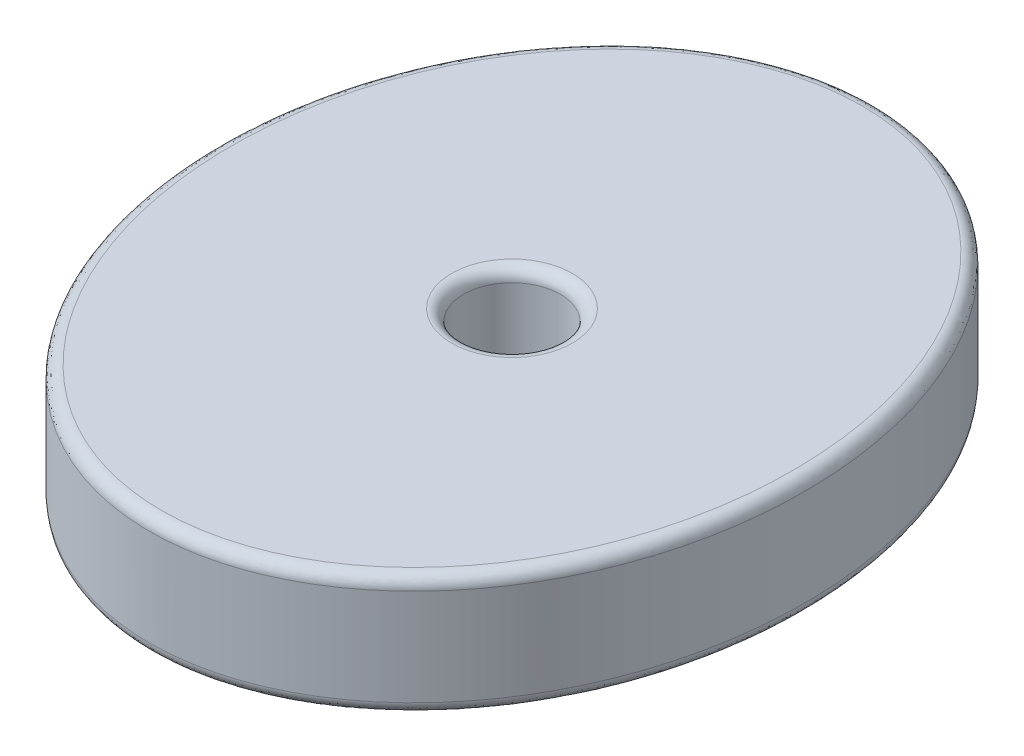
ISO-10303-21;
HEADER;
FILE_DESCRIPTION(('STEP AP214'),'2;1');
FILE_NAME('part.step','',(''),(''),'','','');
FILE_SCHEMA(('AUTOMOTIVE_DESIGN { 1 0 10303 214 1 1 1 1 }'));
ENDSEC;
DATA;
#1=APPLICATION_CONTEXT('core data for automotive mechanical design processes');
#2=APPLICATION_PROTOCOL_DEFINITION('international standard','automotive_design',2000,#1);
#3=PRODUCT_CONTEXT('',#1,'mechanical');
#4=PRODUCT('Part','Part','',(#3));
#5=PRODUCT_RELATED_PRODUCT_CATEGORY('part','',(#4));
#6=PRODUCT_DEFINITION_FORMATION('','',#4);
#7=PRODUCT_DEFINITION_CONTEXT('part definition',#1,'design');
#8=PRODUCT_DEFINITION('design','',#6,#7);
#9=PRODUCT_DEFINITION_SHAPE('','',#8);
#10=(LENGTH_UNIT() NAMED_UNIT(*) SI_UNIT(.MILLI.,.METRE.));
#11=(NAMED_UNIT(*) PLANE_ANGLE_UNIT() SI_UNIT($,.RADIAN.));
#12=(NAMED_UNIT(*) SI_UNIT($,.STERADIAN.) SOLID_ANGLE_UNIT());
#13=UNCERTAINTY_MEASURE_WITH_UNIT(LENGTH_MEASURE(1.E-05),#10,'distance_accuracy_value','');
#14=(GEOMETRIC_REPRESENTATION_CONTEXT(3) GLOBAL_UNCERTAINTY_ASSIGNED_CONTEXT((#13)) GLOBAL_UNIT_ASSIGNED_CONTEXT((#10,
#11,#12)) REPRESENTATION_CONTEXT('',''));
#15=CARTESIAN_POINT('',(0.,0.,0.));
#16=DIRECTION('',(0.,0.,1.));
#17=DIRECTION('',(1.,0.,0.));
#18=AXIS2_PLACEMENT_3D('',#15,#16,#17);
#19=CARTESIAN_POINT('',(0.,10.,0.));
#20=DIRECTION('',(0.,1.,0.));
#21=DIRECTION('',(0.,0.,1.));
#22=AXIS2_PLACEMENT_3D('',#19,#20,#21);
#23=PLANE('',#22);
#24=CARTESIAN_POINT('',(0.,10.,0.));
#25=DIRECTION('',(0.,1.,0.));
#26=DIRECTION('',(0.,0.,1.));
#27=AXIS2_PLACEMENT_3D('',#24,#25,#26);
#28=CIRCLE('',#27,5.);
#29=CARTESIAN_POINT('',(0.,10.,5.));
#30=VERTEX_POINT('',#29);
#31=EDGE_CURVE('E103',#30,#30,#28,.F.);
#32=ORIENTED_EDGE('',*,*,#31,.T.);
#33=EDGE_LOOP('',(#32));
#34=FACE_BOUND('',#33,.T.);
#35=CARTESIAN_POINT('',(-3.52682919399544,10.,-28.6638411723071));
#36=CARTESIAN_POINT('',(-3.71513508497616,10.,-29.6459515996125));
#37=CARTESIAN_POINT('',(-3.71513508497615,9.,-29.6459515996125));
#38=CARTESIAN_POINT('',(-2.96318722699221,10.,-28.7719171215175));
#39=CARTESIAN_POINT('',(-3.12178859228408,10.,-29.7597234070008));
#40=CARTESIAN_POINT('',(-3.12178859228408,9.,-29.7597234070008));
#41=CARTESIAN_POINT('',(-2.39467478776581,10.,-28.8543710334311));
#42=CARTESIAN_POINT('',(-2.52303535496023,10.,-29.8465733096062));
#43=CARTESIAN_POINT('',(-2.52303535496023,9.,-29.8465733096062));
#44=CARTESIAN_POINT('',(-1.25249433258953,10.,-28.9666415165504));
#45=CARTESIAN_POINT('',(-1.31979425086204,10.,-29.9648454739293));
#46=CARTESIAN_POINT('',(-1.31979425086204,9.,-29.9648454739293));
#47=CARTESIAN_POINT('',(-0.678826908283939,10.,-28.9964640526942));
#48=CARTESIAN_POINT('',(-0.715307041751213,10.,-29.9962740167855));
#49=CARTESIAN_POINT('',(-0.715307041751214,9.,-29.9962740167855));
#50=CARTESIAN_POINT('',(0.468576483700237,10.,-29.0029420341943));
#51=CARTESIAN_POINT('',(0.493757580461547,10.,-30.0031001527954));
#52=CARTESIAN_POINT('',(0.493757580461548,9.,-30.0031001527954));
#53=CARTESIAN_POINT('',(1.04231234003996,10.,-28.9796179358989));
#54=CARTESIAN_POINT('',(1.09833486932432,10.,-29.9785193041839));
#55=CARTESIAN_POINT('',(1.09833486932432,9.,-29.9785193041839));
#56=CARTESIAN_POINT('',(2.1851882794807,10.,-28.8802623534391));
#57=CARTESIAN_POINT('',(2.30237780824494,10.,-29.8738462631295));
#58=CARTESIAN_POINT('',(2.30237780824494,9.,-29.8738462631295));
#59=CARTESIAN_POINT('',(2.75432848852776,10.,-28.8042323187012));
#60=CARTESIAN_POINT('',(2.90184359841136,10.,-29.7937555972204));
#61=CARTESIAN_POINT('',(2.90184359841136,9.,-29.7937555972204));
#62=CARTESIAN_POINT('',(3.83599049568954,10.,-28.6093381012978));
#63=CARTESIAN_POINT('',(4.0406381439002,10.,-29.5885676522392));
#64=CARTESIAN_POINT('',(4.0406381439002,9.,-29.5885676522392));
#65=CARTESIAN_POINT('',(4.34926164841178,10.,-28.4945952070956));
#66=CARTESIAN_POINT('',(4.58079821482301,10.,-29.467802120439));
#67=CARTESIAN_POINT('',(4.58079821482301,9.,-29.467802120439));
#68=CARTESIAN_POINT('',(5.36467647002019,10.,-28.2236214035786));
#69=CARTESIAN_POINT('',(5.64881125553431,10.,-29.1827920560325));
#70=CARTESIAN_POINT('',(5.64881125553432,9.,-29.1827920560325));
#71=CARTESIAN_POINT('',(5.86682097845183,10.,-28.0673936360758));
#72=CARTESIAN_POINT('',(6.17666515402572,10.,-29.018550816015));
#73=CARTESIAN_POINT('',(6.17666515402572,9.,-29.018550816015));
#74=CARTESIAN_POINT('',(6.85708150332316,10.,-27.7155030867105));
#75=CARTESIAN_POINT('',(7.21691840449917,10.,-28.6488955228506));
#76=CARTESIAN_POINT('',(7.21691840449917,9.,-28.6488955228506));
#77=CARTESIAN_POINT('',(7.34519703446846,10.,-27.5198389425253));
#78=CARTESIAN_POINT('',(7.72931722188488,10.,-28.4434800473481));
#79=CARTESIAN_POINT('',(7.72931722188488,9.,-28.4434800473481));
#80=CARTESIAN_POINT('',(8.30487701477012,10.,-27.0914704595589));
#81=CARTESIAN_POINT('',(8.73596922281,10.,-27.9941449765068));
#82=CARTESIAN_POINT('',(8.73596922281,9.,-27.9941449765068));
#83=CARTESIAN_POINT('',(8.77644055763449,10.,-26.8587640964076));
#84=CARTESIAN_POINT('',(9.23022141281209,10.,-27.7502232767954));
#85=CARTESIAN_POINT('',(9.23022141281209,9.,-27.7502232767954));
#86=CARTESIAN_POINT('',(9.72747553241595,10.,-26.3445358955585));
#87=CARTESIAN_POINT('',(10.2261991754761,10.,-27.2116947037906));
#88=CARTESIAN_POINT('',(10.2261991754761,9.,-27.2116947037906));
#89=CARTESIAN_POINT('',(10.2058466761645,10.,-26.0609785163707));
#90=CARTESIAN_POINT('',(10.7267247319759,10.,-26.914981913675));
#91=CARTESIAN_POINT('',(10.7267247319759,9.,-26.914981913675));
#92=CARTESIAN_POINT('',(11.1398566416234,10.,-25.4584959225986));
#93=CARTESIAN_POINT('',(11.7031260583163,10.,-26.2851543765));
#94=CARTESIAN_POINT('',(11.7031260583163,9.,-26.2851543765));
#95=CARTESIAN_POINT('',(11.5954871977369,10.,-25.1395579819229));
#96=CARTESIAN_POINT('',(12.178992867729,10.,-25.952026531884));
#97=CARTESIAN_POINT('',(12.178992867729,9.,-25.952026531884));
#98=CARTESIAN_POINT('',(12.9257948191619,10.,-24.134483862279));
#99=CARTESIAN_POINT('',(13.5671574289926,10.,-24.9032434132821));
#100=CARTESIAN_POINT('',(13.5671574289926,9.,-24.9032434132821));
#101=CARTESIAN_POINT('',(13.7643206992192,10.,-23.3998494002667));
#102=CARTESIAN_POINT('',(14.4404724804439,10.,-24.1379390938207));
#103=CARTESIAN_POINT('',(14.4404724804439,9.,-24.1379390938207));
#104=CARTESIAN_POINT('',(15.457899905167,10.,-21.7045726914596));
#105=CARTESIAN_POINT('',(16.2015595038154,10.,-22.3750939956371));
#106=CARTESIAN_POINT('',(16.2015595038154,9.,-22.3750939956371));
#107=CARTESIAN_POINT('',(16.2954050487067,10.,-20.726548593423));
#108=CARTESIAN_POINT('',(17.0706284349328,10.,-21.3599422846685));
#109=CARTESIAN_POINT('',(17.0706284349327,9.,-21.3599422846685));
#110=CARTESIAN_POINT('',(17.8266845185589,10.,-18.6640909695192));
#111=CARTESIAN_POINT('',(18.6572974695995,10.,-19.2228758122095));
#112=CARTESIAN_POINT('',(18.6572974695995,9.,-19.2228758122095));
#113=CARTESIAN_POINT('',(18.5203692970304,10.,-17.579591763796));
#114=CARTESIAN_POINT('',(19.3748032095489,10.,-18.1008951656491));
#115=CARTESIAN_POINT('',(19.3748032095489,9.,-18.1008951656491));
#116=CARTESIAN_POINT('',(19.8876842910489,10.,-15.1073526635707));
#117=CARTESIAN_POINT('',(20.7874984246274,10.,-15.5466152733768));
#118=CARTESIAN_POINT('',(20.7874984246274,9.,-15.5466152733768));
#119=CARTESIAN_POINT('',(20.5299439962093,10.,-13.7021757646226));
#120=CARTESIAN_POINT('',(21.4499275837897,10.,-14.0969524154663));
#121=CARTESIAN_POINT('',(21.4499275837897,9.,-14.0969524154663));
#122=CARTESIAN_POINT('',(21.340333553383,10.,-11.5385942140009));
#123=CARTESIAN_POINT('',(22.2850533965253,10.,-11.86730969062));
#124=CARTESIAN_POINT('',(22.2850533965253,9.,-11.86730969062));
#125=CARTESIAN_POINT('',(21.585058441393,10.,-10.807668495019));
#126=CARTESIAN_POINT('',(22.5371066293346,10.,-11.1144626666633));
#127=CARTESIAN_POINT('',(22.5371066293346,9.,-11.1144626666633));
#128=CARTESIAN_POINT('',(22.0241305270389,10.,-9.33080545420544));
#129=CARTESIAN_POINT('',(22.9891552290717,10.,-9.59395122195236));
#130=CARTESIAN_POINT('',(22.9891552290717,9.,-9.59395122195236));
#131=CARTESIAN_POINT('',(22.2184718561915,10.,-8.58486639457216));
#132=CARTESIAN_POINT('',(23.1891445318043,10.,-8.82628508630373));
#133=CARTESIAN_POINT('',(23.1891445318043,9.,-8.82628508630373));
#134=CARTESIAN_POINT('',(22.7886884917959,10.,-6.05346411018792));
#135=CARTESIAN_POINT('',(23.7757891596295,10.,-6.22199045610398));
#136=CARTESIAN_POINT('',(23.7757891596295,9.,-6.22199045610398));
#137=CARTESIAN_POINT('',(23.0497617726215,10.,-4.24031488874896));
#138=CARTESIAN_POINT('',(24.0441096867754,10.,-4.35801758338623));
#139=CARTESIAN_POINT('',(24.0441096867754,9.,-4.35801758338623));
#140=CARTESIAN_POINT('',(23.2335624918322,10.,-1.50867735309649));
#141=CARTESIAN_POINT('',(24.2330097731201,10.,-1.55044835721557));
#142=CARTESIAN_POINT('',(24.2330097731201,9.,-1.55044835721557));
#143=CARTESIAN_POINT('',(23.2601303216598,10.,-0.595386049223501));
#144=CARTESIAN_POINT('',(24.2603136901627,10.,-0.611876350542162));
#145=CARTESIAN_POINT('',(24.2603136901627,9.,-0.611876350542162));
#146=CARTESIAN_POINT('',(23.2440330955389,10.,1.2308987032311));
#147=CARTESIAN_POINT('',(24.2437722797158,10.,1.26498966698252));
#148=CARTESIAN_POINT('',(24.2437722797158,9.,1.26498966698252));
#149=CARTESIAN_POINT('',(23.2013667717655,10.,2.14389214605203));
#150=CARTESIAN_POINT('',(24.199925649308,10.,2.20328367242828));
#151=CARTESIAN_POINT('',(24.199925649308,9.,2.20328367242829));
#152=CARTESIAN_POINT('',(23.0386872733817,10.,4.05679802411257));
#153=CARTESIAN_POINT('',(24.0327141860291,10.,4.16947809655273));
#154=CARTESIAN_POINT('',(24.0327141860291,9.,4.16947809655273));
#155=CARTESIAN_POINT('',(22.9112299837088,10.,5.05607938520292));
#156=CARTESIAN_POINT('',(23.9016960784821,10.,5.1967583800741));
#157=CARTESIAN_POINT('',(23.9016960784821,9.,5.1967583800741));
#158=CARTESIAN_POINT('',(22.5714176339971,10.,7.04032264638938));
#159=CARTESIAN_POINT('',(23.5522529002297,10.,7.23723948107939));
#160=CARTESIAN_POINT('',(23.5522529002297,9.,7.23723948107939));
#161=CARTESIAN_POINT('',(22.3590496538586,10.,8.02528234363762));
#162=CARTESIAN_POINT('',(23.3338145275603,10.,8.25043813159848));
#163=CARTESIAN_POINT('',(23.3338145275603,9.,8.25043813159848));
#164=CARTESIAN_POINT('',(21.8487218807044,10.,9.97221949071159));
#165=CARTESIAN_POINT('',(22.8086037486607,10.,10.254155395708));
#166=CARTESIAN_POINT('',(22.8086037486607,9.,10.254155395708));
#167=CARTESIAN_POINT('',(21.5508125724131,10.,10.9342101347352));
#168=CARTESIAN_POINT('',(22.501883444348,10.,11.2446870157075));
#169=CARTESIAN_POINT('',(22.501883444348,9.,11.2446870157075));
#170=CARTESIAN_POINT('',(20.8683526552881,10.,12.8268938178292));
#171=CARTESIAN_POINT('',(21.7987153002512,10.,13.1948031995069));
#172=CARTESIAN_POINT('',(21.7987153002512,9.,13.1948031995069));
#173=CARTESIAN_POINT('',(20.4838255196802,10.,13.7575952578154));
#174=CARTESIAN_POINT('',(21.4022917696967,10.,14.1543960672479));
#175=CARTESIAN_POINT('',(21.4022917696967,9.,14.1543960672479));
#176=CARTESIAN_POINT('',(19.7261434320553,10.,15.3674736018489));
#177=CARTESIAN_POINT('',(20.6204295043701,10.,15.8156487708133));
#178=CARTESIAN_POINT('',(20.6204295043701,9.,15.8156487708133));
#179=CARTESIAN_POINT('',(19.3708666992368,10.,16.0551040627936));
#180=CARTESIAN_POINT('',(20.253592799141,10.,16.5257014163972));
#181=CARTESIAN_POINT('',(20.253592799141,9.,16.5257014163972));
#182=CARTESIAN_POINT('',(18.6081394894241,10.,17.4008655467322));
#183=CARTESIAN_POINT('',(19.4653899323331,10.,17.9164130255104));
#184=CARTESIAN_POINT('',(19.4653899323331,9.,17.9164130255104));
#185=CARTESIAN_POINT('',(18.2006930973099,10.,18.0589988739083));
#186=CARTESIAN_POINT('',(19.0440280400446,10.,18.5970742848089));
#187=CARTESIAN_POINT('',(19.0440280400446,9.,18.5970742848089));
#188=CARTESIAN_POINT('',(17.334073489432,10.,19.3391673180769));
#189=CARTESIAN_POINT('',(18.1469488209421,10.,19.9222375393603));
#190=CARTESIAN_POINT('',(18.1469488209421,9.,19.9222375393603));
#191=CARTESIAN_POINT('',(16.8749651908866,10.,19.9612462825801));
#192=CARTESIAN_POINT('',(17.6712996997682,10.,20.5667834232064));
#193=CARTESIAN_POINT('',(17.6712996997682,9.,20.5667834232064));
#194=CARTESIAN_POINT('',(15.9049535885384,10.,21.1636602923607));
#195=CARTESIAN_POINT('',(16.665249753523,10.,21.813870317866));
#196=CARTESIAN_POINT('',(16.6652497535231,9.,21.813870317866));
#197=CARTESIAN_POINT('',(15.3940591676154,10.,21.7440024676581));
#198=CARTESIAN_POINT('',(16.1348583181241,10.,22.4164185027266));
#199=CARTESIAN_POINT('',(16.1348583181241,9.,22.4164185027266));
#200=CARTESIAN_POINT('',(14.4195228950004,10.,22.7541246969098));
#201=CARTESIAN_POINT('',(15.1219208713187,10.,23.4663433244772));
#202=CARTESIAN_POINT('',(15.1219208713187,9.,23.4663433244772));
#203=CARTESIAN_POINT('',(13.9643001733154,10.,23.1920415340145));
#204=CARTESIAN_POINT('',(14.6483364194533,10.,23.9219576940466));
#205=CARTESIAN_POINT('',(14.6483364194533,9.,23.9219576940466));
#206=CARTESIAN_POINT('',(13.0209706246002,10.,24.0308717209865));
#207=CARTESIAN_POINT('',(13.6659486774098,10.,24.7955193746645));
#208=CARTESIAN_POINT('',(13.6659486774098,9.,24.7955193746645));
#209=CARTESIAN_POINT('',(12.5328693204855,10.,24.4317912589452));
#210=CARTESIAN_POINT('',(13.1571513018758,10.,25.2134729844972));
#211=CARTESIAN_POINT('',(13.1571513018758,9.,25.2134729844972));
#212=CARTESIAN_POINT('',(11.5250296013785,10.,25.1923363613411));
#213=CARTESIAN_POINT('',(12.1054625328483,10.,26.0071075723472));
#214=CARTESIAN_POINT('',(12.1054625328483,9.,26.0071075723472));
#215=CARTESIAN_POINT('',(11.0052755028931,10.,25.5519411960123));
#216=CARTESIAN_POINT('',(11.5625542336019,10.,26.3827673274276));
#217=CARTESIAN_POINT('',(11.5625542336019,9.,26.3827673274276));
#218=CARTESIAN_POINT('',(9.93659199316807,10.,26.2249335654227));
#219=CARTESIAN_POINT('',(10.4450775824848,10.,27.0864863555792));
#220=CARTESIAN_POINT('',(10.4450775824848,9.,27.0864863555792));
#221=CARTESIAN_POINT('',(9.38766329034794,10.,26.5383222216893));
#222=CARTESIAN_POINT('',(9.87050999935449,10.,27.4145467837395));
#223=CARTESIAN_POINT('',(9.87050999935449,9.,27.4145467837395));
#224=CARTESIAN_POINT('',(8.25856087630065,10.,27.116839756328));
#225=CARTESIAN_POINT('',(8.68747210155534,10.,28.0206987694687));
#226=CARTESIAN_POINT('',(8.68747210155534,9.,28.0206987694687));
#227=CARTESIAN_POINT('',(7.67814912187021,10.,27.3815056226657));
#228=CARTESIAN_POINT('',(8.07874176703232,10.,28.2983106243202));
#229=CARTESIAN_POINT('',(8.07874176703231,9.,28.2983106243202));
#230=CARTESIAN_POINT('',(6.49482647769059,10.,27.8544790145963));
#231=CARTESIAN_POINT('',(6.83654676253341,10.,28.7948146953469));
#232=CARTESIAN_POINT('',(6.8365467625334,9.,28.7948146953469));
#233=CARTESIAN_POINT('',(5.8919193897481,10.,28.0627960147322));
#234=CARTESIAN_POINT('',(6.20308627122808,10.,29.0137167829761));
#235=CARTESIAN_POINT('',(6.20308627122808,9.,29.0137167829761));
#236=CARTESIAN_POINT('',(4.67030293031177,10.,28.418675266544));
#237=CARTESIAN_POINT('',(4.91860566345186,10.,29.3879091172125));
#238=CARTESIAN_POINT('',(4.91860566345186,9.,29.3879091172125));
#239=CARTESIAN_POINT('',(4.05164428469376,10.,28.5664114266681));
#240=CARTESIAN_POINT('',(4.2676416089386,10.,29.5433814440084));
#241=CARTESIAN_POINT('',(4.2676416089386,9.,29.5433814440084));
#242=CARTESIAN_POINT('',(2.80295078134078,10.,28.7988877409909));
#243=CARTESIAN_POINT('',(2.95306852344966,10.,29.7881221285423));
#244=CARTESIAN_POINT('',(2.95306852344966,9.,29.7881221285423));
#245=CARTESIAN_POINT('',(2.17292594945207,10.,28.8836808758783));
#246=CARTESIAN_POINT('',(2.28947061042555,10.,29.8774461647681));
#247=CARTESIAN_POINT('',(2.28947061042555,9.,29.8774461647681));
#248=CARTESIAN_POINT('',(1.28429581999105,10.,28.9574239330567));
#249=CARTESIAN_POINT('',(1.35326368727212,10.,29.9551382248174));
#250=CARTESIAN_POINT('',(1.35326368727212,9.,29.9551382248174));
#251=CARTESIAN_POINT('',(1.02770989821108,10.,28.973382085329));
#252=CARTESIAN_POINT('',(1.08291434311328,10.,29.9719525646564));
#253=CARTESIAN_POINT('',(1.08291434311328,9.,29.9719525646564));
#254=CARTESIAN_POINT('',(0.514093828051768,10.,28.9946713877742));
#255=CARTESIAN_POINT('',(0.541721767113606,10.,29.994384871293));
#256=CARTESIAN_POINT('',(0.541721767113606,9.,29.994384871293));
#257=CARTESIAN_POINT('',(0.257063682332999,10.,29.0000026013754));
#258=CARTESIAN_POINT('',(0.270878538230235,10.,30.000002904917));
#259=CARTESIAN_POINT('',(0.270878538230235,9.,30.000002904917));
#260=CARTESIAN_POINT('',(-0.546200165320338,10.,28.9999944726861));
#261=CARTESIAN_POINT('',(-0.575553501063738,10.,29.9999938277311));
#262=CARTESIAN_POINT('',(-0.575553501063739,9.,29.9999938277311));
#263=CARTESIAN_POINT('',(-1.09255173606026,10.,28.9759087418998));
#264=CARTESIAN_POINT('',(-1.15126641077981,10.,29.974611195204));
#265=CARTESIAN_POINT('',(-1.15126641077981,9.,29.974611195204));
#266=CARTESIAN_POINT('',(-2.18127001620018,10.,28.8799156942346));
#267=CARTESIAN_POINT('',(-2.29824638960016,10.,29.873481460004));
#268=CARTESIAN_POINT('',(-2.29824638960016,9.,29.873481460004));
#269=CARTESIAN_POINT('',(-2.72363417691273,10.,28.8079800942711));
#270=CARTESIAN_POINT('',(-2.86951062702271,10.,29.7977045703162));
#271=CARTESIAN_POINT('',(-2.86951062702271,9.,29.7977045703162));
#272=CARTESIAN_POINT('',(-3.80119910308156,10.,28.617214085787));
#273=CARTESIAN_POINT('',(-4.00402474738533,10.,29.5968567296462));
#274=CARTESIAN_POINT('',(-4.00402474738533,9.,29.5968567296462));
#275=CARTESIAN_POINT('',(-4.33638288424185,10.,28.498287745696));
#276=CARTESIAN_POINT('',(-4.56725577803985,10.,29.4716849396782));
#277=CARTESIAN_POINT('',(-4.56725577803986,9.,29.4716849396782));
#278=CARTESIAN_POINT('',(-5.39470914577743,10.,28.2153469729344));
#279=CARTESIAN_POINT('',(-5.68039611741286,10.,29.1740900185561));
#280=CARTESIAN_POINT('',(-5.68039611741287,9.,29.1740900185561));
#281=CARTESIAN_POINT('',(-5.91785053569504,10.,28.051328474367));
#282=CARTESIAN_POINT('',(-6.23030421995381,10.,29.0016626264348));
#283=CARTESIAN_POINT('',(-6.23030421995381,9.,29.0016626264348));
#284=CARTESIAN_POINT('',(-6.94619508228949,10.,27.6814714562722));
#285=CARTESIAN_POINT('',(-7.31049274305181,10.,28.6131595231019));
#286=CARTESIAN_POINT('',(-7.31049274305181,9.,28.6131595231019));
#287=CARTESIAN_POINT('',(-7.45147365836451,10.,27.4758420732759));
#288=CARTESIAN_POINT('',(-7.84085622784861,10.,28.3973021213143));
#289=CARTESIAN_POINT('',(-7.84085622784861,9.,28.3973021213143));
#290=CARTESIAN_POINT('',(-8.44400226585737,10.,27.0249576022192));
#291=CARTESIAN_POINT('',(-8.88182629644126,10.,27.9244119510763));
#292=CARTESIAN_POINT('',(-8.88182629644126,9.,27.9244119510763));
#293=CARTESIAN_POINT('',(-8.9312517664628,10.,26.7797013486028));
#294=CARTESIAN_POINT('',(-9.39243229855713,10.,27.6673779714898));
#295=CARTESIAN_POINT('',(-9.39243229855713,9.,27.6673779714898));
#296=CARTESIAN_POINT('',(-9.88518270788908,10.,26.2526179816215));
#297=CARTESIAN_POINT('',(-10.3912391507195,10.,27.115499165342));
#298=CARTESIAN_POINT('',(-10.3912391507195,9.,27.115499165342));
#299=CARTESIAN_POINT('',(-10.3518744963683,10.,25.9708095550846));
#300=CARTESIAN_POINT('',(-10.8794512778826,10.,26.8206736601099));
#301=CARTESIAN_POINT('',(-10.8794512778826,9.,26.8206736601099));
#302=CARTESIAN_POINT('',(-11.2633044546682,10.,25.3734405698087));
#303=CARTESIAN_POINT('',(-11.8320808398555,10.,26.1963017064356));
#304=CARTESIAN_POINT('',(-11.8320808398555,9.,26.1963017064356));
#305=CARTESIAN_POINT('',(-11.7080347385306,10.,25.0578680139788));
#306=CARTESIAN_POINT('',(-12.2964897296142,10.,25.866742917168));
#307=CARTESIAN_POINT('',(-12.2964897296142,9.,25.866742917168));
#308=CARTESIAN_POINT('',(-12.6135098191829,10.,24.3658484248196));
#309=CARTESIAN_POINT('',(-13.2412163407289,10.,25.1447253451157));
#310=CARTESIAN_POINT('',(-13.2412163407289,9.,25.1447253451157));
#311=CARTESIAN_POINT('',(-13.0720188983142,10.,23.9864745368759));
#312=CARTESIAN_POINT('',(-13.7191251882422,10.,24.7492712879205));
#313=CARTESIAN_POINT('',(-13.7191251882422,9.,24.7492712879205));
#314=CARTESIAN_POINT('',(-13.9598849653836,10.,23.1949171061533));
#315=CARTESIAN_POINT('',(-14.6437229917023,10.,23.9249657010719));
#316=CARTESIAN_POINT('',(-14.6437229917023,9.,23.9249657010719));
#317=CARTESIAN_POINT('',(-14.3892316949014,10.,22.7827221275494));
#318=CARTESIAN_POINT('',(-15.0904009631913,10.,23.4961025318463));
#319=CARTESIAN_POINT('',(-15.0904009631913,9.,23.4961025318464));
#320=CARTESIAN_POINT('',(-15.6321370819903,10.,21.5023111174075));
#321=CARTESIAN_POINT('',(-16.382381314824,10.,22.165140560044));
#322=CARTESIAN_POINT('',(-16.382381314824,9.,22.165140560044));
#323=CARTESIAN_POINT('',(-16.4008223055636,10.,20.590066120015));
#324=CARTESIAN_POINT('',(-17.1799026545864,10.,21.2184575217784));
#325=CARTESIAN_POINT('',(-17.1799026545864,9.,21.2184575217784));
#326=CARTESIAN_POINT('',(-17.9463969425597,10.,18.4959064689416));
#327=CARTESIAN_POINT('',(-18.7812846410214,10.,19.0486896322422));
#328=CARTESIAN_POINT('',(-18.7812846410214,9.,19.0486896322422));
#329=CARTESIAN_POINT('',(-18.6980588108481,10.,17.2954336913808));
#330=CARTESIAN_POINT('',(-19.5585660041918,10.,17.8069894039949));
#331=CARTESIAN_POINT('',(-19.5585660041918,9.,17.8069894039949));
#332=CARTESIAN_POINT('',(-19.6949666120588,10.,15.4263300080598));
#333=CARTESIAN_POINT('',(-20.5882441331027,10.,15.8764313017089));
#334=CARTESIAN_POINT('',(-20.5882441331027,9.,15.8764313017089));
#335=CARTESIAN_POINT('',(-20.0056487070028,10.,14.7915043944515));
#336=CARTESIAN_POINT('',(-20.9089107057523,10.,15.2211734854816));
#337=CARTESIAN_POINT('',(-20.9089107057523,9.,15.2211734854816));
#338=CARTESIAN_POINT('',(-20.5839224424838,10.,13.502497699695));
#339=CARTESIAN_POINT('',(-21.5054477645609,10.,13.8914562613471));
#340=CARTESIAN_POINT('',(-21.5054477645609,9.,13.8914562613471));
#341=CARTESIAN_POINT('',(-20.8515095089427,10.,12.8483145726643));
#342=CARTESIAN_POINT('',(-21.7813134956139,10.,13.2169948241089));
#343=CARTESIAN_POINT('',(-21.7813134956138,9.,13.2169948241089));
#344=CARTESIAN_POINT('',(-21.687891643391,10.,10.5985856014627));
#345=CARTESIAN_POINT('',(-22.643207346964,10.,10.8986653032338));
#346=CARTESIAN_POINT('',(-22.643207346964,9.,10.8986653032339));
#347=CARTESIAN_POINT('',(-22.1556326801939,10.,8.96390390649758));
#348=CARTESIAN_POINT('',(-23.1245461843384,10.,9.21603474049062));
#349=CARTESIAN_POINT('',(-23.1245461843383,9.,9.21603474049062));
#350=CARTESIAN_POINT('',(-22.6757709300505,10.,6.4761831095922));
#351=CARTESIAN_POINT('',(-23.6595776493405,10.,6.65704174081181));
#352=CARTESIAN_POINT('',(-23.6595776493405,9.,6.65704174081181));
#353=CARTESIAN_POINT('',(-22.8189362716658,10.,5.64047851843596));
#354=CARTESIAN_POINT('',(-23.8067909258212,10.,5.79767419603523));
#355=CARTESIAN_POINT('',(-23.8067909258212,9.,5.79767419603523));
#356=CARTESIAN_POINT('',(-23.0453406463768,10.,3.96088193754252));
#357=CARTESIAN_POINT('',(-24.0395572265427,10.,4.0708821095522));
#358=CARTESIAN_POINT('',(-24.0395572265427,9.,4.0708821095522));
#359=CARTESIAN_POINT('',(-23.1285771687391,10.,3.11698960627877));
#360=CARTESIAN_POINT('',(-24.1251076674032,10.,3.20345723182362));
#361=CARTESIAN_POINT('',(-24.1251076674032,9.,3.20345723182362));
#362=CARTESIAN_POINT('',(-23.3045154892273,10.,0.32846336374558));
#363=CARTESIAN_POINT('',(-24.3059421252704,10.,0.337453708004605));
#364=CARTESIAN_POINT('',(-24.3059421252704,9.,0.337453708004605));
#365=CARTESIAN_POINT('',(-23.2697314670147,10.,-1.62559350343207));
#366=CARTESIAN_POINT('',(-24.2702030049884,10.,-1.67044424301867));
#367=CARTESIAN_POINT('',(-24.2702030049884,9.,-1.67044424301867));
#368=CARTESIAN_POINT('',(-22.8838681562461,10.,-5.50488675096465));
#369=CARTESIAN_POINT('',(-23.8735712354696,10.,-5.65803854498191));
#370=CARTESIAN_POINT('',(-23.8735712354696,9.,-5.65803854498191));
#371=CARTESIAN_POINT('',(-22.5324514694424,10.,-7.43009016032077));
#372=CARTESIAN_POINT('',(-23.5123317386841,10.,-7.63770252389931));
#373=CARTESIAN_POINT('',(-23.5123317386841,9.,-7.63770252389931));
#374=CARTESIAN_POINT('',(-21.7563901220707,10.,-10.2811468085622));
#375=CARTESIAN_POINT('',(-22.7135422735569,10.,-10.5722132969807));
#376=CARTESIAN_POINT('',(-22.7135422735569,9.,-10.5722132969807));
#377=CARTESIAN_POINT('',(-21.4493327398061,10.,-11.2400639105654));
#378=CARTESIAN_POINT('',(-22.3973671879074,10.,-11.5597039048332));
#379=CARTESIAN_POINT('',(-22.3973671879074,9.,-11.5597039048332));
#380=CARTESIAN_POINT('',(-20.7482915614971,10.,-13.1261586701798));
#381=CARTESIAN_POINT('',(-21.6749517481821,10.,-13.5033113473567));
#382=CARTESIAN_POINT('',(-21.6749517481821,9.,-13.5033113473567));
#383=CARTESIAN_POINT('',(-20.354293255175,10.,-14.0533309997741));
#384=CARTESIAN_POINT('',(-21.2686963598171,10.,-14.4594229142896));
#385=CARTESIAN_POINT('',(-21.2686963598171,9.,-14.4594229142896));
#386=CARTESIAN_POINT('',(-19.4793476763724,10.,-15.8635390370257));
#387=CARTESIAN_POINT('',(-20.3656607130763,10.,-16.3277467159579));
#388=CARTESIAN_POINT('',(-20.3656607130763,9.,-16.3277467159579));
#389=CARTESIAN_POINT('',(-18.9985721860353,10.,-16.7466576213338));
#390=CARTESIAN_POINT('',(-19.8690592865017,10.,-17.2400412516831));
#391=CARTESIAN_POINT('',(-19.8690592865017,9.,-17.2400412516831));
#392=CARTESIAN_POINT('',(-17.9490190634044,10.,-18.458812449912));
#393=CARTESIAN_POINT('',(-18.7836812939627,10.,-19.0106396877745));
#394=CARTESIAN_POINT('',(-18.7836812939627,9.,-19.0106396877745));
#395=CARTESIAN_POINT('',(-17.3802889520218,10.,-19.2878775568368));
#396=CARTESIAN_POINT('',(-18.1949545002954,10.,-19.8689723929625));
#397=CARTESIAN_POINT('',(-18.1949545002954,9.,-19.8689723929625));
#398=CARTESIAN_POINT('',(-16.3593700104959,10.,-20.6134061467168));
#399=CARTESIAN_POINT('',(-17.1366698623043,10.,-21.2430123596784));
#400=CARTESIAN_POINT('',(-17.1366698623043,9.,-21.2430123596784));
#401=CARTESIAN_POINT('',(-15.93144576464,10.,-21.128685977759));
#402=CARTESIAN_POINT('',(-16.6927192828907,10.,-21.7776281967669));
#403=CARTESIAN_POINT('',(-16.6927192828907,9.,-21.7776281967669));
#404=CARTESIAN_POINT('',(-15.0371463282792,10.,-22.1246459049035));
#405=CARTESIAN_POINT('',(-15.7640048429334,10.,-22.811915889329));
#406=CARTESIAN_POINT('',(-15.7640048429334,9.,-22.811915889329));
#407=CARTESIAN_POINT('',(-14.570781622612,10.,-22.6053353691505));
#408=CARTESIAN_POINT('',(-15.2792521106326,10.,-23.3115972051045));
#409=CARTESIAN_POINT('',(-15.2792521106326,9.,-23.3115972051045));
#410=CARTESIAN_POINT('',(-13.6006010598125,10.,-23.5271436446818));
#411=CARTESIAN_POINT('',(-14.269741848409,10.,-24.2707739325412));
#412=CARTESIAN_POINT('',(-14.269741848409,9.,-24.2707739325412));
#413=CARTESIAN_POINT('',(-13.0967946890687,10.,-23.9682724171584));
#414=CARTESIAN_POINT('',(-13.7449944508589,10.,-24.7302794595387));
#415=CARTESIAN_POINT('',(-13.7449944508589,9.,-24.7302794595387));
#416=CARTESIAN_POINT('',(-12.0531576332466,10.,-24.8058297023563));
#417=CARTESIAN_POINT('',(-12.6567620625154,10.,-25.6036259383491));
#418=CARTESIAN_POINT('',(-12.6567620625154,9.,-25.6036259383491));
#419=CARTESIAN_POINT('',(-11.5133253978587,10.,-25.2022562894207));
#420=CARTESIAN_POINT('',(-12.0932754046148,10.,-26.0174649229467));
#421=CARTESIAN_POINT('',(-12.0932754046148,9.,-26.0174649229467));
#422=CARTESIAN_POINT('',(-10.394835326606,10.,-25.9483011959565));
#423=CARTESIAN_POINT('',(-10.9244529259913,10.,-26.7970816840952));
#424=CARTESIAN_POINT('',(-10.9244529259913,9.,-26.7970816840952));
#425=CARTESIAN_POINT('',(-9.81586293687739,10.,-26.297449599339));
#426=CARTESIAN_POINT('',(-10.3187764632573,10.,-27.1623763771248));
#427=CARTESIAN_POINT('',(-10.3187764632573,9.,-27.1623763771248));
#428=CARTESIAN_POINT('',(-8.62706969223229,10.,-26.938803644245));
#429=CARTESIAN_POINT('',(-9.07377840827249,10.,-27.8340523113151));
#430=CARTESIAN_POINT('',(-9.07377840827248,9.,-27.8340523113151));
#431=CARTESIAN_POINT('',(-8.01724827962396,10.,-27.2310082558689));
#432=CARTESIAN_POINT('',(-8.43445620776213,10.,-28.1404324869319));
#433=CARTESIAN_POINT('',(-8.43445620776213,9.,-28.1404324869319));
#434=CARTESIAN_POINT('',(-6.77194717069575,10.,-27.7527432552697));
#435=CARTESIAN_POINT('',(-7.12760907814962,10.,-28.6879523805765));
#436=CARTESIAN_POINT('',(-7.12760907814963,9.,-28.6879523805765));
#437=CARTESIAN_POINT('',(-6.13649212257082,10.,-27.9823322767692));
#438=CARTESIAN_POINT('',(-6.46011121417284,10.,-28.9291531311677));
#439=CARTESIAN_POINT('',(-6.46011121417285,9.,-28.9291531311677));
#440=CARTESIAN_POINT('',(-4.84520826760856,10.,-28.3743533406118));
#441=CARTESIAN_POINT('',(-5.10260779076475,10.,-29.3412768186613));
#442=CARTESIAN_POINT('',(-5.10260779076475,9.,-29.3412768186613));
#443=CARTESIAN_POINT('',(-4.18938367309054,10.,-28.5367991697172));
#444=CARTESIAN_POINT('',(-4.4126068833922,10.,-29.5122141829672));
#445=CARTESIAN_POINT('',(-4.4126068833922,9.,-29.5122141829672));
#446=CARTESIAN_POINT('',(-3.52682919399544,10.,-28.6638411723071));
#447=CARTESIAN_POINT('',(-3.71513508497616,10.,-29.6459515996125));
#448=CARTESIAN_POINT('',(-3.71513508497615,9.,-29.6459515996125));
#449=(BOUNDED_SURFACE() B_SPLINE_SURFACE(3,2,((#35,#36,#37),(#38,#39,#40),(#41,#42,#43),(#44,
#45,#46),(#47,#48,#49),(#50,#51,#52),(#53,#54,#55),(#56,#57,#58),(#59,#60,#61),(#62,#63,#64),
(#65,#66,#67),(#68,#69,#70),(#71,#72,#73),(#74,#75,#76),(#77,#78,#79),(#80,#81,#82),(#83,#84,
#85),(#86,#87,#88),(#89,#90,#91),(#92,#93,#94),(#95,#96,#97),(#98,#99,#100),(#101,#102,#103),
(#104,#105,#106),(#107,#108,#109),(#110,#111,#112),(#113,#114,#115),(#116,#117,#118),(#119,#120,
#121),(#122,#123,#124),(#125,#126,#127),(#128,#129,#130),(#131,#132,#133),(#134,#135,#136),
(#137,#138,#139),(#140,#141,#142),(#143,#144,#145),(#146,#147,#148),(#149,#150,#151),(#152,#153,
#154),(#155,#156,#157),(#158,#159,#160),(#161,#162,#163),(#164,#165,#166),(#167,#168,#169),
(#170,#171,#172),(#173,#174,#175),(#176,#177,#178),(#179,#180,#181),(#182,#183,#184),(#185,#186,
#187),(#188,#189,#190),(#191,#192,#193),(#194,#195,#196),(#197,#198,#199),(#200,#201,#202),
(#203,#204,#205),(#206,#207,#208),(#209,#210,#211),(#212,#213,#214),(#215,#216,#217),(#218,#219,
#220),(#221,#222,#223),(#224,#225,#226),(#227,#228,#229),(#230,#231,#232),(#233,#234,#235),
(#236,#237,#238),(#239,#240,#241),(#242,#243,#244),(#245,#246,#247),(#248,#249,#250),(#251,#252,
#253),(#254,#255,#256),(#257,#258,#259),(#260,#261,#262),(#263,#264,#265),(#266,#267,#268),
(#269,#270,#271),(#272,#273,#274),(#275,#276,#277),(#278,#279,#280),(#281,#282,#283),(#284,#285,
#286),(#287,#288,#289),(#290,#291,#292),(#293,#294,#295),(#296,#297,#298),(#299,#300,#301),
(#302,#303,#304),(#305,#306,#307),(#308,#309,#310),(#311,#312,#313),(#314,#315,#316),(#317,#318,
#319),(#320,#321,#322),(#323,#324,#325),(#326,#327,#328),(#329,#330,#331),(#332,#333,#334),
(#335,#336,#337),(#338,#339,#340),(#341,#342,#343),(#344,#345,#346),(#347,#348,#349),(#350,#351,
#352),(#353,#354,#355),(#356,#357,#358),(#359,#360,#361),(#362,#363,#364),(#365,#366,#367),
(#368,#369,#370),(#371,#372,#373),(#374,#375,#376),(#377,#378,#379),(#380,#381,#382),(#383,#384,
#385),(#386,#387,#388),(#389,#390,#391),(#392,#393,#394),(#395,#396,#397),(#398,#399,#400),
(#401,#402,#403),(#404,#405,#406),(#407,#408,#409),(#410,#411,#412),(#413,#414,#415),(#416,#417,
#418),(#419,#420,#421),(#422,#423,#424),(#425,#426,#427),(#428,#429,#430),(#431,#432,#433),
(#434,#435,#436),(#437,#438,#439),(#440,#441,#442),(#443,#444,#445),(#446,#447,#448)),
.UNSPECIFIED.,.T.,.F.,.F.) B_SPLINE_SURFACE_WITH_KNOTS((4,2,2,2,2,2,2,2,2,2,2,2,2,2,2,2,2,2,2,2,
2,2,2,2,2,2,2,2,2,2,2,2,2,2,2,2,2,2,2,2,2,2,2,2,2,2,2,2,2,2,2,2,2,2,2,2,2,2,2,2,2,2,2,2,2,2,2,2,
4),(3,3),(0.,1.72104554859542,3.44189603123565,5.16208426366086,6.88222519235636,
8.45828422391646,10.0342239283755,11.6102180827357,13.1862983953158,14.8528631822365,
16.5200293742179,19.8528944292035,23.7018652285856,27.5532253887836,32.1698224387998,
34.4807361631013,36.7919189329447,42.2611367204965,45.0002775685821,47.739468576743,
50.7580026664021,53.7769962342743,56.7942117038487,59.8106104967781,62.1304671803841,
64.4501423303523,66.7669345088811,69.0833299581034,70.9765385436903,72.8694298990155,
74.7632669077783,76.6570579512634,78.5680086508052,80.4786378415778,82.3837431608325,
84.2872430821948,85.0583142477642,85.8293808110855,87.4677168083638,89.1070220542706,
90.7496913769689,92.3925088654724,94.027265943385,95.6620711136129,97.2960437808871,
98.9305989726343,100.714155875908,102.498336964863,106.065715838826,110.29868011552,
112.417646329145,114.536837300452,119.614715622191,122.156721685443,124.698834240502,
130.534876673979,136.377145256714,139.394251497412,142.411861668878,145.423562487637,
148.43364176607,150.441285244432,152.448382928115,154.454973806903,156.461651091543,
158.487002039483,160.512389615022,162.535874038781,164.558942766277),(0.,1.),
.UNSPECIFIED.) GEOMETRIC_REPRESENTATION_ITEM() RATIONAL_B_SPLINE_SURFACE(((1.,0.707106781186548,
1.),(1.,0.707106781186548,1.),(1.,0.707106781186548,1.),(1.,0.707106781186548,1.),(1.,
0.707106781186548,1.),(1.,0.707106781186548,1.),(1.,0.707106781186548,1.),(1.,0.707106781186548,
1.),(1.,0.707106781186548,1.),(1.,0.707106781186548,1.),(1.,0.707106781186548,1.),(1.,
0.707106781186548,1.),(1.,0.707106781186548,1.),(1.,0.707106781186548,1.),(1.,0.707106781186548,
1.),(1.,0.707106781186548,1.),(1.,0.707106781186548,1.),(1.,0.707106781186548,1.),(1.,
0.707106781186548,1.),(1.,0.707106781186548,1.),(1.,0.707106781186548,1.),(1.,0.707106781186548,
1.),(1.,0.707106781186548,1.),(1.,0.707106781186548,1.),(1.,0.707106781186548,1.),(1.,
0.707106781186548,1.),(1.,0.707106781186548,1.),(1.,0.707106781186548,1.),(1.,0.707106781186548,
1.),(1.,0.707106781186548,1.),(1.,0.707106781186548,1.),(1.,0.707106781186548,1.),(1.,
0.707106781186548,1.),(1.,0.707106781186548,1.),(1.,0.707106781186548,1.),(1.,0.707106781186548,
1.),(1.,0.707106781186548,1.),(1.,0.707106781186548,1.),(1.,0.707106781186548,1.),(1.,
0.707106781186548,1.),(1.,0.707106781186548,1.),(1.,0.707106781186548,1.),(1.,0.707106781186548,
1.),(1.,0.707106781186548,1.),(1.,0.707106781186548,1.),(1.,0.707106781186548,1.),(1.,
0.707106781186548,1.),(1.,0.707106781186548,1.),(1.,0.707106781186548,1.),(1.,0.707106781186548,
1.),(1.,0.707106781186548,1.),(1.,0.707106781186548,1.),(1.,0.707106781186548,1.),(1.,
0.707106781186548,1.),(1.,0.707106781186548,1.),(1.,0.707106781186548,1.),(1.,0.707106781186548,
1.),(1.,0.707106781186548,1.),(1.,0.707106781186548,1.),(1.,0.707106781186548,1.),(1.,
0.707106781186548,1.),(1.,0.707106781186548,1.),(1.,0.707106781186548,1.),(1.,0.707106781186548,
1.),(1.,0.707106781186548,1.),(1.,0.707106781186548,1.),(1.,0.707106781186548,1.),(1.,
0.707106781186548,1.),(1.,0.707106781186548,1.),(1.,0.707106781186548,1.),(1.,0.707106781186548,
1.),(1.,0.707106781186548,1.),(1.,0.707106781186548,1.),(1.,0.707106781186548,1.),(1.,
0.707106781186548,1.),(1.,0.707106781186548,1.),(1.,0.707106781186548,1.),(1.,0.707106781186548,
1.),(1.,0.707106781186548,1.),(1.,0.707106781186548,1.),(1.,0.707106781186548,1.),(1.,
0.707106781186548,1.),(1.,0.707106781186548,1.),(1.,0.707106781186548,1.),(1.,0.707106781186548,
1.),(1.,0.707106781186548,1.),(1.,0.707106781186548,1.),(1.,0.707106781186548,1.),(1.,
0.707106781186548,1.),(1.,0.707106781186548,1.),(1.,0.707106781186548,1.),(1.,0.707106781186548,
1.),(1.,0.707106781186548,1.),(1.,0.707106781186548,1.),(1.,0.707106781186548,1.),(1.,
0.707106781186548,1.),(1.,0.707106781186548,1.),(1.,0.707106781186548,1.),(1.,0.707106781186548,
1.),(1.,0.707106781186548,1.),(1.,0.707106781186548,1.),(1.,0.707106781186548,1.),(1.,
0.707106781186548,1.),(1.,0.707106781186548,1.),(1.,0.707106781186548,1.),(1.,0.707106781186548,
1.),(1.,0.707106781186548,1.),(1.,0.707106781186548,1.),(1.,0.707106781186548,1.),(1.,
0.707106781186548,1.),(1.,0.707106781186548,1.),(1.,0.707106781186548,1.),(1.,0.707106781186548,
1.),(1.,0.707106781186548,1.),(1.,0.707106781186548,1.),(1.,0.707106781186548,1.),(1.,
0.707106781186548,1.),(1.,0.707106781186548,1.),(1.,0.707106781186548,1.),(1.,0.707106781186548,
1.),(1.,0.707106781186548,1.),(1.,0.707106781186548,1.),(1.,0.707106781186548,1.),(1.,
0.707106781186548,1.),(1.,0.707106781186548,1.),(1.,0.707106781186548,1.),(1.,0.707106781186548,
1.),(1.,0.707106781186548,1.),(1.,0.707106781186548,1.),(1.,0.707106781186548,1.),(1.,
0.707106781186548,1.),(1.,0.707106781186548,1.),(1.,0.707106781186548,1.),(1.,0.707106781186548,
1.),(1.,0.707106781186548,1.),(1.,0.707106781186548,1.),(1.,0.707106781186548,1.),(1.,
0.707106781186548,1.))) REPRESENTATION_ITEM('') SURFACE());
#450=CARTESIAN_POINT('',(-3.52682919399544,10.,-28.6638411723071));
#451=CARTESIAN_POINT('',(-4.18938367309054,10.,-28.5367991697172));
#452=CARTESIAN_POINT('',(-4.84520826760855,10.,-28.3743533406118));
#453=CARTESIAN_POINT('',(-6.13649212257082,10.,-27.9823322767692));
#454=CARTESIAN_POINT('',(-6.77194717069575,10.,-27.7527432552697));
#455=CARTESIAN_POINT('',(-8.01724827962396,10.,-27.2310082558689));
#456=CARTESIAN_POINT('',(-8.62706969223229,10.,-26.938803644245));
#457=CARTESIAN_POINT('',(-9.81586293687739,10.,-26.297449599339));
#458=CARTESIAN_POINT('',(-10.394835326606,10.,-25.9483011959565));
#459=CARTESIAN_POINT('',(-11.5133253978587,10.,-25.2022562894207));
#460=CARTESIAN_POINT('',(-12.0531576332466,10.,-24.8058297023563));
#461=CARTESIAN_POINT('',(-13.0967946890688,10.,-23.9682724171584));
#462=CARTESIAN_POINT('',(-13.6006010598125,10.,-23.5271436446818));
#463=CARTESIAN_POINT('',(-14.570781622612,10.,-22.6053353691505));
#464=CARTESIAN_POINT('',(-15.0371463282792,10.,-22.1246459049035));
#465=CARTESIAN_POINT('',(-15.93144576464,10.,-21.128685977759));
#466=CARTESIAN_POINT('',(-16.3593700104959,10.,-20.6134061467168));
#467=CARTESIAN_POINT('',(-17.3802889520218,10.,-19.2878775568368));
#468=CARTESIAN_POINT('',(-17.9490190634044,10.,-18.458812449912));
#469=CARTESIAN_POINT('',(-18.9985721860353,10.,-16.7466576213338));
#470=CARTESIAN_POINT('',(-19.4793476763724,10.,-15.8635390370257));
#471=CARTESIAN_POINT('',(-20.354293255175,10.,-14.0533309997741));
#472=CARTESIAN_POINT('',(-20.7482915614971,10.,-13.1261586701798));
#473=CARTESIAN_POINT('',(-21.4493327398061,10.,-11.2400639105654));
#474=CARTESIAN_POINT('',(-21.7563901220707,10.,-10.2811468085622));
#475=CARTESIAN_POINT('',(-22.5324514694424,10.,-7.43009016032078));
#476=CARTESIAN_POINT('',(-22.8838681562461,10.,-5.50488675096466));
#477=CARTESIAN_POINT('',(-23.2697314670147,10.,-1.62559350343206));
#478=CARTESIAN_POINT('',(-23.3045154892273,10.,0.328463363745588));
#479=CARTESIAN_POINT('',(-23.1285771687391,10.,3.11698960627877));
#480=CARTESIAN_POINT('',(-23.0453406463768,10.,3.96088193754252));
#481=CARTESIAN_POINT('',(-22.8189362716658,10.,5.64047851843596));
#482=CARTESIAN_POINT('',(-22.6757709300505,10.,6.4761831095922));
#483=CARTESIAN_POINT('',(-22.1556326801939,10.,8.96390390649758));
#484=CARTESIAN_POINT('',(-21.687891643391,10.,10.5985856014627));
#485=CARTESIAN_POINT('',(-20.8515095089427,10.,12.8483145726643));
#486=CARTESIAN_POINT('',(-20.5839224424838,10.,13.502497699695));
#487=CARTESIAN_POINT('',(-20.0056487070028,10.,14.7915043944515));
#488=CARTESIAN_POINT('',(-19.6949666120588,10.,15.4263300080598));
#489=CARTESIAN_POINT('',(-18.6980588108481,10.,17.2954336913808));
#490=CARTESIAN_POINT('',(-17.9463969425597,10.,18.4959064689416));
#491=CARTESIAN_POINT('',(-16.4008223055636,10.,20.590066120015));
#492=CARTESIAN_POINT('',(-15.6321370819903,10.,21.5023111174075));
#493=CARTESIAN_POINT('',(-14.3892316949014,10.,22.7827221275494));
#494=CARTESIAN_POINT('',(-13.9598849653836,10.,23.1949171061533));
#495=CARTESIAN_POINT('',(-13.0720188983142,10.,23.9864745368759));
#496=CARTESIAN_POINT('',(-12.6135098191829,10.,24.3658484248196));
#497=CARTESIAN_POINT('',(-11.7080347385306,10.,25.0578680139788));
#498=CARTESIAN_POINT('',(-11.2633044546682,10.,25.3734405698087));
#499=CARTESIAN_POINT('',(-10.3518744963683,10.,25.9708095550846));
#500=CARTESIAN_POINT('',(-9.88518270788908,10.,26.2526179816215));
#501=CARTESIAN_POINT('',(-8.9312517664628,10.,26.7797013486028));
#502=CARTESIAN_POINT('',(-8.44400226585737,10.,27.0249576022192));
#503=CARTESIAN_POINT('',(-7.45147365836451,10.,27.4758420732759));
#504=CARTESIAN_POINT('',(-6.94619508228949,10.,27.6814714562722));
#505=CARTESIAN_POINT('',(-5.91785053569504,10.,28.051328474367));
#506=CARTESIAN_POINT('',(-5.39470914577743,10.,28.2153469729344));
#507=CARTESIAN_POINT('',(-4.33638288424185,10.,28.498287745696));
#508=CARTESIAN_POINT('',(-3.80119910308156,10.,28.617214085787));
#509=CARTESIAN_POINT('',(-2.72363417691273,10.,28.8079800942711));
#510=CARTESIAN_POINT('',(-2.18127001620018,10.,28.8799156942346));
#511=CARTESIAN_POINT('',(-1.09255173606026,10.,28.9759087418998));
#512=CARTESIAN_POINT('',(-0.546200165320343,10.,28.9999944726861));
#513=CARTESIAN_POINT('',(0.257063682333,10.,29.0000026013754));
#514=CARTESIAN_POINT('',(0.51409382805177,10.,28.9946713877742));
#515=CARTESIAN_POINT('',(1.02770989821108,10.,28.973382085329));
#516=CARTESIAN_POINT('',(1.28429581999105,10.,28.9574239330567));
#517=CARTESIAN_POINT('',(2.17292594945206,10.,28.8836808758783));
#518=CARTESIAN_POINT('',(2.80295078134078,10.,28.7988877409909));
#519=CARTESIAN_POINT('',(4.05164428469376,10.,28.5664114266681));
#520=CARTESIAN_POINT('',(4.67030293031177,10.,28.418675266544));
#521=CARTESIAN_POINT('',(5.8919193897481,10.,28.0627960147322));
#522=CARTESIAN_POINT('',(6.49482647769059,10.,27.8544790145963));
#523=CARTESIAN_POINT('',(7.67814912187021,10.,27.3815056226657));
#524=CARTESIAN_POINT('',(8.25856087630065,10.,27.116839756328));
#525=CARTESIAN_POINT('',(9.38766329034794,10.,26.5383222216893));
#526=CARTESIAN_POINT('',(9.93659199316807,10.,26.2249335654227));
#527=CARTESIAN_POINT('',(11.0052755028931,10.,25.5519411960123));
#528=CARTESIAN_POINT('',(11.5250296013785,10.,25.1923363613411));
#529=CARTESIAN_POINT('',(12.5328693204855,10.,24.4317912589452));
#530=CARTESIAN_POINT('',(13.0209706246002,10.,24.0308717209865));
#531=CARTESIAN_POINT('',(13.9643001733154,10.,23.1920415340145));
#532=CARTESIAN_POINT('',(14.4195228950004,10.,22.7541246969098));
#533=CARTESIAN_POINT('',(15.3940591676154,10.,21.7440024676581));
#534=CARTESIAN_POINT('',(15.9049535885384,10.,21.1636602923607));
#535=CARTESIAN_POINT('',(16.8749651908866,10.,19.9612462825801));
#536=CARTESIAN_POINT('',(17.334073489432,10.,19.3391673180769));
#537=CARTESIAN_POINT('',(18.2006930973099,10.,18.0589988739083));
#538=CARTESIAN_POINT('',(18.6081394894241,10.,17.4008655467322));
#539=CARTESIAN_POINT('',(19.3708666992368,10.,16.0551040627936));
#540=CARTESIAN_POINT('',(19.7261434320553,10.,15.3674736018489));
#541=CARTESIAN_POINT('',(20.4838255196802,10.,13.7575952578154));
#542=CARTESIAN_POINT('',(20.8683526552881,10.,12.8268938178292));
#543=CARTESIAN_POINT('',(21.5508125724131,10.,10.9342101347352));
#544=CARTESIAN_POINT('',(21.8487218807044,10.,9.97221949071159));
#545=CARTESIAN_POINT('',(22.3590496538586,10.,8.02528234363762));
#546=CARTESIAN_POINT('',(22.5714176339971,10.,7.04032264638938));
#547=CARTESIAN_POINT('',(22.9112299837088,10.,5.05607938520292));
#548=CARTESIAN_POINT('',(23.0386872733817,10.,4.05679802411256));
#549=CARTESIAN_POINT('',(23.2013667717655,10.,2.14389214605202));
#550=CARTESIAN_POINT('',(23.2440330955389,10.,1.2308987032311));
#551=CARTESIAN_POINT('',(23.2601303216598,10.,-0.595386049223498));
#552=CARTESIAN_POINT('',(23.2335624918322,10.,-1.50867735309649));
#553=CARTESIAN_POINT('',(23.0497617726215,10.,-4.24031488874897));
#554=CARTESIAN_POINT('',(22.7886884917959,10.,-6.0534641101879));
#555=CARTESIAN_POINT('',(22.2184718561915,10.,-8.58486639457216));
#556=CARTESIAN_POINT('',(22.0241305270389,10.,-9.33080545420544));
#557=CARTESIAN_POINT('',(21.585058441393,10.,-10.807668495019));
#558=CARTESIAN_POINT('',(21.340333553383,10.,-11.5385942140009));
#559=CARTESIAN_POINT('',(20.5299439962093,10.,-13.7021757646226));
#560=CARTESIAN_POINT('',(19.8876842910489,10.,-15.1073526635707));
#561=CARTESIAN_POINT('',(18.5203692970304,10.,-17.579591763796));
#562=CARTESIAN_POINT('',(17.8266845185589,10.,-18.6640909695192));
#563=CARTESIAN_POINT('',(16.2954050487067,10.,-20.726548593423));
#564=CARTESIAN_POINT('',(15.457899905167,10.,-21.7045726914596));
#565=CARTESIAN_POINT('',(13.7643206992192,10.,-23.3998494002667));
#566=CARTESIAN_POINT('',(12.9257948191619,10.,-24.134483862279));
#567=CARTESIAN_POINT('',(11.5954871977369,10.,-25.1395579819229));
#568=CARTESIAN_POINT('',(11.1398566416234,10.,-25.4584959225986));
#569=CARTESIAN_POINT('',(10.2058466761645,10.,-26.0609785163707));
#570=CARTESIAN_POINT('',(9.72747553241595,10.,-26.3445358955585));
#571=CARTESIAN_POINT('',(8.77644055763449,10.,-26.8587640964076));
#572=CARTESIAN_POINT('',(8.30487701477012,10.,-27.0914704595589));
#573=CARTESIAN_POINT('',(7.34519703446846,10.,-27.5198389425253));
#574=CARTESIAN_POINT('',(6.85708150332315,10.,-27.7155030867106));
#575=CARTESIAN_POINT('',(5.86682097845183,10.,-28.0673936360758));
#576=CARTESIAN_POINT('',(5.3646764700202,10.,-28.2236214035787));
#577=CARTESIAN_POINT('',(4.34926164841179,10.,-28.4945952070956));
#578=CARTESIAN_POINT('',(3.83599049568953,10.,-28.6093381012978));
#579=CARTESIAN_POINT('',(2.75432848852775,10.,-28.8042323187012));
#580=CARTESIAN_POINT('',(2.1851882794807,10.,-28.8802623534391));
#581=CARTESIAN_POINT('',(1.04231234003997,10.,-28.9796179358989));
#582=CARTESIAN_POINT('',(0.468576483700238,10.,-29.0029420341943));
#583=CARTESIAN_POINT('',(-0.678826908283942,10.,-28.9964640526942));
#584=CARTESIAN_POINT('',(-1.25249433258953,10.,-28.9666415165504));
#585=CARTESIAN_POINT('',(-2.39467478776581,10.,-28.8543710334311));
#586=CARTESIAN_POINT('',(-2.96318722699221,10.,-28.7719171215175));
#587=CARTESIAN_POINT('',(-3.52682919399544,10.,-28.6638411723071));
#588=B_SPLINE_CURVE_WITH_KNOTS('',3,(#450,#451,#452,#453,#454,#455,#456,#457,#458,#459,#460,
#461,#462,#463,#464,#465,#466,#467,#468,#469,#470,#471,#472,#473,#474,#475,#476,#477,#478,#479,
#480,#481,#482,#483,#484,#485,#486,#487,#488,#489,#490,#491,#492,#493,#494,#495,#496,#497,#498,
#499,#500,#501,#502,#503,#504,#505,#506,#507,#508,#509,#510,#511,#512,#513,#514,#515,#516,#517,
#518,#519,#520,#521,#522,#523,#524,#525,#526,#527,#528,#529,#530,#531,#532,#533,#534,#535,#536,
#537,#538,#539,#540,#541,#542,#543,#544,#545,#546,#547,#548,#549,#550,#551,#552,#553,#554,#555,
#556,#557,#558,#559,#560,#561,#562,#563,#564,#565,#566,#567,#568,#569,#570,#571,#572,#573,#574,
#575,#576,#577,#578,#579,#580,#581,#582,#583,#584,#585,#586,#587),.UNSPECIFIED.,.T.,.F.,(4,2,2,
2,2,2,2,2,2,2,2,2,2,2,2,2,2,2,2,2,2,2,2,2,2,2,2,2,2,2,2,2,2,2,2,2,2,2,2,2,2,2,2,2,2,2,2,2,2,2,2,
2,2,2,2,2,2,2,2,2,2,2,2,2,2,2,2,2,4),(0.,2.02306872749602,4.04655315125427,6.07194072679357,
8.09729167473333,10.1039689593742,12.1105598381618,14.1176575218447,16.125301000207,
19.1353802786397,22.1470810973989,25.1646912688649,28.1817975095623,34.0240660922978,
39.8601085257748,42.4022210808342,44.9442271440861,50.0221054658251,52.1412964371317,
54.2602626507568,58.4932269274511,62.0606058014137,63.8447868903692,65.6283437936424,
67.2628989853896,68.8968716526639,70.5316768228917,72.1664339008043,73.8092513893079,
75.4519207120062,77.0912259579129,78.7295619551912,79.5006285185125,80.271699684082,
82.1751996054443,84.080304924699,85.9909341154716,87.9018848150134,89.7956758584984,
91.6895128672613,93.5824042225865,95.4756128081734,97.7920082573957,100.108800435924,
102.428475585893,104.748332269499,107.764731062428,110.781946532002,113.800940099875,
116.819474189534,119.558665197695,122.29780604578,127.767023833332,130.078206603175,
132.389120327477,137.005717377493,140.857077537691,144.706048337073,148.038913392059,
149.70607958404,151.372644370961,152.948724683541,154.524718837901,156.10065854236,
157.67671757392,159.396858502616,161.117046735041,162.837897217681,164.558942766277),.UNSPECIFIED.);
#589=CARTESIAN_POINT('',(-3.52682919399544,10.,-28.6638411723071));
#590=VERTEX_POINT('',#589);
#591=EDGE_CURVE('E98',#590,#590,#588,.T.);
#592=ORIENTED_EDGE('',*,*,#591,.T.);
#593=EDGE_LOOP('',(#592));
#594=FACE_BOUND('',#593,.T.);
#595=ADVANCED_FACE('F32',(#34,#594),#23,.T.);
#596=CARTESIAN_POINT('',(0.,0.,0.));
#597=DIRECTION('',(0.,1.,0.));
#598=DIRECTION('',(0.,0.,1.));
#599=AXIS2_PLACEMENT_3D('',#596,#597,#598);
#600=PLANE('',#599);
#601=CARTESIAN_POINT('',(3.52682919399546,0.,-28.6638411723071));
#602=CARTESIAN_POINT('',(3.71513508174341,0.,-29.6459516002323));
#603=CARTESIAN_POINT('',(3.71513508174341,0.999999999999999,-29.6459516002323));
#604=CARTESIAN_POINT('',(2.96318722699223,0.,-28.7719171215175));
#605=CARTESIAN_POINT('',(3.12178858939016,0.,-29.759723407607));
#606=CARTESIAN_POINT('',(3.12178858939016,0.999999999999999,-29.759723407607));
#607=CARTESIAN_POINT('',(2.39467478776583,0.,-28.8543710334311));
#608=CARTESIAN_POINT('',(2.52303535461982,0.,-29.8465733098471));
#609=CARTESIAN_POINT('',(2.52303535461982,0.999999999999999,-29.8465733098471));
#610=CARTESIAN_POINT('',(1.25249433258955,0.,-28.9666415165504));
#611=CARTESIAN_POINT('',(1.31979425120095,0.,-29.9648454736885));
#612=CARTESIAN_POINT('',(1.31979425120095,0.999999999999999,-29.9648454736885));
#613=CARTESIAN_POINT('',(0.678826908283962,0.,-28.9964640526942));
#614=CARTESIAN_POINT('',(0.715307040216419,0.,-29.9962740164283));
#615=CARTESIAN_POINT('',(0.715307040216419,0.999999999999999,-29.9962740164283));
#616=CARTESIAN_POINT('',(-0.468576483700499,0.,-29.0029420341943));
#617=CARTESIAN_POINT('',(-0.493757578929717,0.,-30.0031001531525));
#618=CARTESIAN_POINT('',(-0.493757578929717,0.999999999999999,-30.0031001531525));
#619=CARTESIAN_POINT('',(-1.04231234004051,0.,-28.9796179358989));
#620=CARTESIAN_POINT('',(-1.09833486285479,0.,-29.9785193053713));
#621=CARTESIAN_POINT('',(-1.09833486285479,0.999999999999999,-29.9785193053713));
#622=CARTESIAN_POINT('',(-2.18518827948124,0.,-28.880262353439));
#623=CARTESIAN_POINT('',(-2.30237781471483,0.,-29.873846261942));
#624=CARTESIAN_POINT('',(-2.30237781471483,0.999999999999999,-29.873846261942));
#625=CARTESIAN_POINT('',(-2.75432848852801,0.,-28.8042323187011));
#626=CARTESIAN_POINT('',(-2.90184362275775,0.,-29.793755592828));
#627=CARTESIAN_POINT('',(-2.90184362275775,0.999999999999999,-29.793755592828));
#628=CARTESIAN_POINT('',(-3.83599049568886,0.,-28.6093381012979));
#629=CARTESIAN_POINT('',(-4.04063816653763,0.,-29.5885676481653));
#630=CARTESIAN_POINT('',(-4.04063816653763,0.999999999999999,-29.5885676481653));
#631=CARTESIAN_POINT('',(-4.34926164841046,0.,-28.4945952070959));
#632=CARTESIAN_POINT('',(-4.58079822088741,0.,-29.4678021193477));
#633=CARTESIAN_POINT('',(-4.58079822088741,0.999999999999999,-29.4678021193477));
#634=CARTESIAN_POINT('',(-5.36467647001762,0.,-28.2236214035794));
#635=CARTESIAN_POINT('',(-5.64881124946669,0.,-29.1827920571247));
#636=CARTESIAN_POINT('',(-5.64881124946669,0.999999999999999,-29.1827920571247));
#637=CARTESIAN_POINT('',(-5.86682097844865,0.,-28.0673936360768));
#638=CARTESIAN_POINT('',(-6.17666515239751,0.,-29.0185508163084));
#639=CARTESIAN_POINT('',(-6.17666515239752,0.999999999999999,-29.0185508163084));
#640=CARTESIAN_POINT('',(-6.85708150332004,0.,-27.7155030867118));
#641=CARTESIAN_POINT('',(-7.21691840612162,0.,-28.6488955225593));
#642=CARTESIAN_POINT('',(-7.21691840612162,0.999999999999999,-28.6488955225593));
#643=CARTESIAN_POINT('',(-7.345197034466,0.,-27.5198389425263));
#644=CARTESIAN_POINT('',(-7.72931722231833,0.,-28.4434800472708));
#645=CARTESIAN_POINT('',(-7.72931722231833,0.999999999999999,-28.4434800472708));
#646=CARTESIAN_POINT('',(-8.30487701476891,0.,-27.0914704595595));
#647=CARTESIAN_POINT('',(-8.73596922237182,0.,-27.9941449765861));
#648=CARTESIAN_POINT('',(-8.73596922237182,0.999999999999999,-27.9941449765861));
#649=CARTESIAN_POINT('',(-8.77644055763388,0.,-26.858764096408));
#650=CARTESIAN_POINT('',(-9.23022141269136,0.,-27.7502232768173));
#651=CARTESIAN_POINT('',(-9.23022141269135,0.999999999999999,-27.7502232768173));
#652=CARTESIAN_POINT('',(-9.72747553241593,0.,-26.3445358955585));
#653=CARTESIAN_POINT('',(-10.2261991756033,0.,-27.2116947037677));
#654=CARTESIAN_POINT('',(-10.2261991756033,0.999999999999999,-27.2116947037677));
#655=CARTESIAN_POINT('',(-10.2058466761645,0.,-26.0609785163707));
#656=CARTESIAN_POINT('',(-10.7267247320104,0.,-26.914981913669));
#657=CARTESIAN_POINT('',(-10.7267247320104,0.999999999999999,-26.914981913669));
#658=CARTESIAN_POINT('',(-11.1398566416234,0.,-25.4584959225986));
#659=CARTESIAN_POINT('',(-11.7031260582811,0.,-26.2851543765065));
#660=CARTESIAN_POINT('',(-11.7031260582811,0.999999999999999,-26.2851543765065));
#661=CARTESIAN_POINT('',(-11.5954871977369,0.,-25.1395579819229));
#662=CARTESIAN_POINT('',(-12.1789928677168,0.,-25.952026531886));
#663=CARTESIAN_POINT('',(-12.1789928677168,0.999999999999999,-25.952026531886));
#664=CARTESIAN_POINT('',(-12.9257948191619,0.,-24.134483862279));
#665=CARTESIAN_POINT('',(-13.5671574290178,0.,-24.9032434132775));
#666=CARTESIAN_POINT('',(-13.5671574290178,0.999999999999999,-24.9032434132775));
#667=CARTESIAN_POINT('',(-13.7643206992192,0.,-23.3998494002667));
#668=CARTESIAN_POINT('',(-14.440472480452,0.,-24.1379390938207));
#669=CARTESIAN_POINT('',(-14.440472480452,0.999999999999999,-24.1379390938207));
#670=CARTESIAN_POINT('',(-15.457899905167,0.,-21.7045726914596));
#671=CARTESIAN_POINT('',(-16.2015595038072,0.,-22.375093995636));
#672=CARTESIAN_POINT('',(-16.2015595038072,0.999999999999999,-22.375093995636));
#673=CARTESIAN_POINT('',(-16.2954050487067,0.,-20.726548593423));
#674=CARTESIAN_POINT('',(-17.0706284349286,0.,-21.3599422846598));
#675=CARTESIAN_POINT('',(-17.0706284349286,0.999999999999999,-21.3599422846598));
#676=CARTESIAN_POINT('',(-17.8266845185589,0.,-18.6640909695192));
#677=CARTESIAN_POINT('',(-18.6572974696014,0.,-19.2228758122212));
#678=CARTESIAN_POINT('',(-18.6572974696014,0.999999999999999,-19.2228758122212));
#679=CARTESIAN_POINT('',(-18.5203692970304,0.,-17.5795917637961));
#680=CARTESIAN_POINT('',(-19.3748032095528,0.,-18.1008951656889));
#681=CARTESIAN_POINT('',(-19.3748032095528,0.999999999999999,-18.1008951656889));
#682=CARTESIAN_POINT('',(-19.8876842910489,0.,-15.1073526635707));
#683=CARTESIAN_POINT('',(-20.7874984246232,0.,-15.5466152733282));
#684=CARTESIAN_POINT('',(-20.7874984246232,0.999999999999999,-15.5466152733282));
#685=CARTESIAN_POINT('',(-20.5299439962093,0.,-13.7021757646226));
#686=CARTESIAN_POINT('',(-21.449927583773,0.,-14.0969524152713));
#687=CARTESIAN_POINT('',(-21.449927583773,0.999999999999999,-14.0969524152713));
#688=CARTESIAN_POINT('',(-21.340333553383,0.,-11.5385942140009));
#689=CARTESIAN_POINT('',(-22.2850533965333,0.,-11.8673096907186));
#690=CARTESIAN_POINT('',(-22.2850533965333,0.999999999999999,-11.8673096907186));
#691=CARTESIAN_POINT('',(-21.585058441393,0.,-10.807668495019));
#692=CARTESIAN_POINT('',(-22.5371066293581,0.,-11.1144626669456));
#693=CARTESIAN_POINT('',(-22.5371066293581,0.999999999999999,-11.1144626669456));
#694=CARTESIAN_POINT('',(-22.0241305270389,0.,-9.33080545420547));
#695=CARTESIAN_POINT('',(-22.9891552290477,0.,-9.5939512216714));
#696=CARTESIAN_POINT('',(-22.9891552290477,0.999999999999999,-9.5939512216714));
#697=CARTESIAN_POINT('',(-22.2184718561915,0.,-8.58486639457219));
#698=CARTESIAN_POINT('',(-23.1891445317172,0.,-8.82628508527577));
#699=CARTESIAN_POINT('',(-23.1891445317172,0.999999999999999,-8.82628508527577));
#700=CARTESIAN_POINT('',(-22.7886884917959,0.,-6.05346411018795));
#701=CARTESIAN_POINT('',(-23.7757891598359,0.,-6.22199045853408));
#702=CARTESIAN_POINT('',(-23.7757891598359,0.999999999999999,-6.22199045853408));
#703=CARTESIAN_POINT('',(-23.0497617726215,0.,-4.240314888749));
#704=CARTESIAN_POINT('',(-24.0441096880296,0.,-4.35801759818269));
#705=CARTESIAN_POINT('',(-24.0441096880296,0.999999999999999,-4.35801759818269));
#706=CARTESIAN_POINT('',(-23.2335624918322,0.,-1.50867735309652));
#707=CARTESIAN_POINT('',(-24.2330097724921,0.,-1.55044834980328));
#708=CARTESIAN_POINT('',(-24.2330097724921,0.999999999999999,-1.55044834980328));
#709=CARTESIAN_POINT('',(-23.2601303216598,0.,-0.595386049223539));
#710=CARTESIAN_POINT('',(-24.2603136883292,0.,-0.611876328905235));
#711=CARTESIAN_POINT('',(-24.2603136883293,0.999999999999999,-0.611876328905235));
#712=CARTESIAN_POINT('',(-23.2440330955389,0.,1.23089870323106));
#713=CARTESIAN_POINT('',(-24.2437722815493,0.,1.26498964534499));
#714=CARTESIAN_POINT('',(-24.2437722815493,0.999999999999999,1.26498964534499));
#715=CARTESIAN_POINT('',(-23.2013667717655,0.,2.14389214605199));
#716=CARTESIAN_POINT('',(-24.199925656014,0.,2.20328359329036));
#717=CARTESIAN_POINT('',(-24.199925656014,0.999999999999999,2.20328359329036));
#718=CARTESIAN_POINT('',(-23.0386872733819,0.,4.05679802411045));
#719=CARTESIAN_POINT('',(-24.0327141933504,0.,4.16947801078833));
#720=CARTESIAN_POINT('',(-24.0327141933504,0.999999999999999,4.16947801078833));
#721=CARTESIAN_POINT('',(-22.9112299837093,0.,5.05607938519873));
#722=CARTESIAN_POINT('',(-23.9016960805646,0.,5.19675835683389));
#723=CARTESIAN_POINT('',(-23.9016960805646,0.999999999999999,5.19675835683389));
#724=CARTESIAN_POINT('',(-22.5714176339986,0.,7.04032264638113));
#725=CARTESIAN_POINT('',(-23.5522528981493,0.,7.23723950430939));
#726=CARTESIAN_POINT('',(-23.5522528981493,0.999999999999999,7.23723950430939));
#727=CARTESIAN_POINT('',(-22.3590496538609,0.,8.02528234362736));
#728=CARTESIAN_POINT('',(-23.3338145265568,0.,8.25043813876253));
#729=CARTESIAN_POINT('',(-23.3338145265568,0.999999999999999,8.25043813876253));
#730=CARTESIAN_POINT('',(-21.8487218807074,0.,9.97221949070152));
#731=CARTESIAN_POINT('',(-22.8086037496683,0.,10.2541553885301));
#732=CARTESIAN_POINT('',(-22.8086037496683,0.999999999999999,10.2541553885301));
#733=CARTESIAN_POINT('',(-21.5508125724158,0.,10.9342101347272));
#734=CARTESIAN_POINT('',(-22.5018834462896,0.,11.2446870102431));
#735=CARTESIAN_POINT('',(-22.5018834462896,0.999999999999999,11.2446870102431));
#736=CARTESIAN_POINT('',(-20.8683526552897,0.,12.8268938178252));
#737=CARTESIAN_POINT('',(-21.7987152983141,0.,13.1948032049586));
#738=CARTESIAN_POINT('',(-21.7987152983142,0.999999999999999,13.1948032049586));
#739=CARTESIAN_POINT('',(-20.4838255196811,0.,13.7575952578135));
#740=CARTESIAN_POINT('',(-21.4022917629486,0.,14.1543960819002));
#741=CARTESIAN_POINT('',(-21.4022917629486,0.999999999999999,14.1543960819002));
#742=CARTESIAN_POINT('',(-19.7261434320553,0.,15.3674736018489));
#743=CARTESIAN_POINT('',(-20.620429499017,0.,15.8156487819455));
#744=CARTESIAN_POINT('',(-20.620429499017,0.999999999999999,15.8156487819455));
#745=CARTESIAN_POINT('',(-19.3708666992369,0.,16.0551040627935));
#746=CARTESIAN_POINT('',(-20.2535927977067,0.,16.5257014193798));
#747=CARTESIAN_POINT('',(-20.2535927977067,0.999999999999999,16.5257014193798));
#748=CARTESIAN_POINT('',(-18.6081394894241,0.,17.4008655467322));
#749=CARTESIAN_POINT('',(-19.4653899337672,0.,17.916413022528));
#750=CARTESIAN_POINT('',(-19.4653899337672,0.999999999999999,17.9164130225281));
#751=CARTESIAN_POINT('',(-18.2006930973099,0.,18.0589988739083));
#752=CARTESIAN_POINT('',(-19.0440280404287,0.,18.5970742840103));
#753=CARTESIAN_POINT('',(-19.0440280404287,0.999999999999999,18.5970742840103));
#754=CARTESIAN_POINT('',(-17.334073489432,0.,19.3391673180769));
#755=CARTESIAN_POINT('',(-18.1469488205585,0.,19.9222375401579));
#756=CARTESIAN_POINT('',(-18.1469488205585,0.999999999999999,19.9222375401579));
#757=CARTESIAN_POINT('',(-16.8749651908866,0.,19.9612462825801));
#758=CARTESIAN_POINT('',(-17.6712996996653,0.,20.5667834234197));
#759=CARTESIAN_POINT('',(-17.6712996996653,0.999999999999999,20.5667834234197));
#760=CARTESIAN_POINT('',(-15.9049535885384,0.,21.1636602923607));
#761=CARTESIAN_POINT('',(-16.6652497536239,0.,21.8138703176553));
#762=CARTESIAN_POINT('',(-16.6652497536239,0.999999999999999,21.8138703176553));
#763=CARTESIAN_POINT('',(-15.3940591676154,0.,21.7440024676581));
#764=CARTESIAN_POINT('',(-16.1348583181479,0.,22.4164185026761));
#765=CARTESIAN_POINT('',(-16.1348583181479,0.999999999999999,22.4164185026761));
#766=CARTESIAN_POINT('',(-14.4195228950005,0.,22.7541246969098));
#767=CARTESIAN_POINT('',(-15.1219208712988,0.,23.466343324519));
#768=CARTESIAN_POINT('',(-15.1219208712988,0.999999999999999,23.466343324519));
#769=CARTESIAN_POINT('',(-13.9643001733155,0.,23.1920415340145));
#770=CARTESIAN_POINT('',(-14.6483364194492,0.,23.9219576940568));
#771=CARTESIAN_POINT('',(-14.6483364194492,0.999999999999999,23.9219576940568));
#772=CARTESIAN_POINT('',(-13.0209706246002,0.,24.0308717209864));
#773=CARTESIAN_POINT('',(-13.6659486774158,0.,24.7955193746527));
#774=CARTESIAN_POINT('',(-13.6659486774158,0.999999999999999,24.7955193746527));
#775=CARTESIAN_POINT('',(-12.5328693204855,0.,24.4317912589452));
#776=CARTESIAN_POINT('',(-13.1571513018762,0.,25.213472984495));
#777=CARTESIAN_POINT('',(-13.1571513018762,0.999999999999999,25.213472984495));
#778=CARTESIAN_POINT('',(-11.5250296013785,0.,25.1923363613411));
#779=CARTESIAN_POINT('',(-12.105462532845,0.,26.0071075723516));
#780=CARTESIAN_POINT('',(-12.105462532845,0.999999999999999,26.0071075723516));
#781=CARTESIAN_POINT('',(-11.0052755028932,0.,25.5519411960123));
#782=CARTESIAN_POINT('',(-11.5625542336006,0.,26.382767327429));
#783=CARTESIAN_POINT('',(-11.5625542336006,0.999999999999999,26.382767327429));
#784=CARTESIAN_POINT('',(-9.93659199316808,0.,26.2249335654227));
#785=CARTESIAN_POINT('',(-10.4450775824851,0.,27.0864863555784));
#786=CARTESIAN_POINT('',(-10.4450775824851,0.999999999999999,27.0864863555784));
#787=CARTESIAN_POINT('',(-9.38766329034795,0.,26.5383222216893));
#788=CARTESIAN_POINT('',(-9.87050999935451,0.,27.4145467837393));
#789=CARTESIAN_POINT('',(-9.8705099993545,0.999999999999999,27.4145467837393));
#790=CARTESIAN_POINT('',(-8.25856087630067,0.,27.116839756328));
#791=CARTESIAN_POINT('',(-8.68747210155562,0.,28.0206987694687));
#792=CARTESIAN_POINT('',(-8.68747210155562,0.999999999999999,28.0206987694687));
#793=CARTESIAN_POINT('',(-7.67814912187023,0.,27.3815056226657));
#794=CARTESIAN_POINT('',(-8.07874176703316,0.,28.2983106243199));
#795=CARTESIAN_POINT('',(-8.07874176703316,0.999999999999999,28.2983106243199));
#796=CARTESIAN_POINT('',(-6.4948264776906,0.,27.8544790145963));
#797=CARTESIAN_POINT('',(-6.83654676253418,0.,28.7948146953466));
#798=CARTESIAN_POINT('',(-6.83654676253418,0.999999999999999,28.7948146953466));
#799=CARTESIAN_POINT('',(-5.89191938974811,0.,28.0627960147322));
#800=CARTESIAN_POINT('',(-6.20308627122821,0.,29.0137167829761));
#801=CARTESIAN_POINT('',(-6.20308627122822,0.999999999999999,29.0137167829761));
#802=CARTESIAN_POINT('',(-4.67030293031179,0.,28.418675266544));
#803=CARTESIAN_POINT('',(-4.91860566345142,0.,29.3879091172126));
#804=CARTESIAN_POINT('',(-4.91860566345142,0.999999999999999,29.3879091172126));
#805=CARTESIAN_POINT('',(-4.05164428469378,0.,28.5664114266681));
#806=CARTESIAN_POINT('',(-4.26764160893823,0.,29.5433814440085));
#807=CARTESIAN_POINT('',(-4.26764160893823,0.999999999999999,29.5433814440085));
#808=CARTESIAN_POINT('',(-2.8029507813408,0.,28.7988877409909));
#809=CARTESIAN_POINT('',(-2.95306852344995,0.,29.7881221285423));
#810=CARTESIAN_POINT('',(-2.95306852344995,0.999999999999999,29.7881221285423));
#811=CARTESIAN_POINT('',(-2.17292594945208,0.,28.8836808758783));
#812=CARTESIAN_POINT('',(-2.28947061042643,0.,29.8774461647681));
#813=CARTESIAN_POINT('',(-2.28947061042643,0.999999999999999,29.877446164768));
#814=CARTESIAN_POINT('',(-1.28429581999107,0.,28.9574239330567));
#815=CARTESIAN_POINT('',(-1.35326368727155,0.,29.9551382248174));
#816=CARTESIAN_POINT('',(-1.35326368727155,0.999999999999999,29.9551382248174));
#817=CARTESIAN_POINT('',(-1.02770989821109,0.,28.973382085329));
#818=CARTESIAN_POINT('',(-1.08291434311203,0.,29.9719525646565));
#819=CARTESIAN_POINT('',(-1.08291434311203,0.999999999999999,29.9719525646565));
#820=CARTESIAN_POINT('',(-0.514093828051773,0.,28.9946713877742));
#821=CARTESIAN_POINT('',(-0.541721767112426,0.,29.994384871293));
#822=CARTESIAN_POINT('',(-0.541721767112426,0.999999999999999,29.994384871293));
#823=CARTESIAN_POINT('',(-0.257063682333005,0.,29.0000026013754));
#824=CARTESIAN_POINT('',(-0.270878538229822,0.,30.000002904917));
#825=CARTESIAN_POINT('',(-0.270878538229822,0.999999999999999,30.0000029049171));
#826=CARTESIAN_POINT('',(0.546200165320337,0.,28.9999944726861));
#827=CARTESIAN_POINT('',(0.575553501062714,0.,29.9999938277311));
#828=CARTESIAN_POINT('',(0.575553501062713,0.999999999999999,29.9999938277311));
#829=CARTESIAN_POINT('',(1.09255173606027,0.,28.9759087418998));
#830=CARTESIAN_POINT('',(1.15126641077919,0.,29.974611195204));
#831=CARTESIAN_POINT('',(1.15126641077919,0.999999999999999,29.974611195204));
#832=CARTESIAN_POINT('',(2.18127001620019,0.,28.8799156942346));
#833=CARTESIAN_POINT('',(2.29824638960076,0.,29.8734814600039));
#834=CARTESIAN_POINT('',(2.29824638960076,0.999999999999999,29.8734814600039));
#835=CARTESIAN_POINT('',(2.72363417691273,0.,28.8079800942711));
#836=CARTESIAN_POINT('',(2.86951062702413,0.,29.7977045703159));
#837=CARTESIAN_POINT('',(2.86951062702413,0.999999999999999,29.7977045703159));
#838=CARTESIAN_POINT('',(3.80119910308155,0.,28.617214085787));
#839=CARTESIAN_POINT('',(4.00402474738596,0.,29.5968567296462));
#840=CARTESIAN_POINT('',(4.00402474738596,0.999999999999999,29.5968567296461));
#841=CARTESIAN_POINT('',(4.33638288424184,0.,28.498287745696));
#842=CARTESIAN_POINT('',(4.56725577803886,0.,29.4716849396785));
#843=CARTESIAN_POINT('',(4.56725577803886,0.999999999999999,29.4716849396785));
#844=CARTESIAN_POINT('',(5.39470914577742,0.,28.2153469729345));
#845=CARTESIAN_POINT('',(5.68039611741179,0.,29.1740900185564));
#846=CARTESIAN_POINT('',(5.68039611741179,0.999999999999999,29.1740900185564));
#847=CARTESIAN_POINT('',(5.91785053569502,0.,28.051328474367));
#848=CARTESIAN_POINT('',(6.23030421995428,0.,29.0016626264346));
#849=CARTESIAN_POINT('',(6.23030421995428,0.999999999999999,29.0016626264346));
#850=CARTESIAN_POINT('',(6.94619508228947,0.,27.6814714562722));
#851=CARTESIAN_POINT('',(7.31049274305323,0.,28.6131595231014));
#852=CARTESIAN_POINT('',(7.31049274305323,0.999999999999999,28.6131595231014));
#853=CARTESIAN_POINT('',(7.4514736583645,0.,27.4758420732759));
#854=CARTESIAN_POINT('',(7.84085622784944,0.,28.3973021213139));
#855=CARTESIAN_POINT('',(7.84085622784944,0.999999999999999,28.3973021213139));
#856=CARTESIAN_POINT('',(8.44400226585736,0.,27.0249576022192));
#857=CARTESIAN_POINT('',(8.8818262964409,0.,27.9244119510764));
#858=CARTESIAN_POINT('',(8.8818262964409,0.999999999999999,27.9244119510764));
#859=CARTESIAN_POINT('',(8.93125176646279,0.,26.7797013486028));
#860=CARTESIAN_POINT('',(9.39243229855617,0.,27.6673779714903));
#861=CARTESIAN_POINT('',(9.39243229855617,0.999999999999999,27.6673779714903));
#862=CARTESIAN_POINT('',(9.88518270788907,0.,26.2526179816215));
#863=CARTESIAN_POINT('',(10.3912391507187,0.,27.1154991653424));
#864=CARTESIAN_POINT('',(10.3912391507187,0.999999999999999,27.1154991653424));
#865=CARTESIAN_POINT('',(10.3518744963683,0.,25.9708095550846));
#866=CARTESIAN_POINT('',(10.8794512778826,0.,26.8206736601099));
#867=CARTESIAN_POINT('',(10.8794512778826,0.999999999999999,26.8206736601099));
#868=CARTESIAN_POINT('',(11.2633044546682,0.,25.3734405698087));
#869=CARTESIAN_POINT('',(11.832080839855,0.,26.196301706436));
#870=CARTESIAN_POINT('',(11.832080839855,0.999999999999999,26.196301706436));
#871=CARTESIAN_POINT('',(11.7080347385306,0.,25.0578680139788));
#872=CARTESIAN_POINT('',(12.2964897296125,0.,25.8667429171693));
#873=CARTESIAN_POINT('',(12.2964897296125,0.999999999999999,25.8667429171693));
#874=CARTESIAN_POINT('',(12.6135098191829,0.,24.3658484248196));
#875=CARTESIAN_POINT('',(13.241216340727,0.,25.1447253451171));
#876=CARTESIAN_POINT('',(13.241216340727,0.999999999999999,25.1447253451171));
#877=CARTESIAN_POINT('',(13.0720188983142,0.,23.9864745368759));
#878=CARTESIAN_POINT('',(13.7191251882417,0.,24.7492712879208));
#879=CARTESIAN_POINT('',(13.7191251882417,0.999999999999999,24.7492712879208));
#880=CARTESIAN_POINT('',(13.9598849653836,0.,23.1949171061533));
#881=CARTESIAN_POINT('',(14.6437229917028,0.,23.9249657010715));
#882=CARTESIAN_POINT('',(14.6437229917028,0.999999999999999,23.9249657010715));
#883=CARTESIAN_POINT('',(14.3892316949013,0.,22.7827221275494));
#884=CARTESIAN_POINT('',(15.0904009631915,0.,23.4961025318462));
#885=CARTESIAN_POINT('',(15.0904009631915,0.999999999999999,23.4961025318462));
#886=CARTESIAN_POINT('',(15.6321370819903,0.,21.5023111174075));
#887=CARTESIAN_POINT('',(16.3823813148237,0.,22.1651405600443));
#888=CARTESIAN_POINT('',(16.3823813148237,0.999999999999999,22.1651405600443));
#889=CARTESIAN_POINT('',(16.4008223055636,0.,20.590066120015));
#890=CARTESIAN_POINT('',(17.1799026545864,0.,21.2184575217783));
#891=CARTESIAN_POINT('',(17.1799026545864,0.999999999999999,21.2184575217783));
#892=CARTESIAN_POINT('',(17.9463969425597,0.,18.4959064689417));
#893=CARTESIAN_POINT('',(18.7812846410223,0.,19.0486896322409));
#894=CARTESIAN_POINT('',(18.7812846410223,0.999999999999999,19.0486896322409));
#895=CARTESIAN_POINT('',(18.698058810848,0.,17.2954336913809));
#896=CARTESIAN_POINT('',(19.5585660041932,0.,17.8069894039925));
#897=CARTESIAN_POINT('',(19.5585660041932,0.999999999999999,17.8069894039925));
#898=CARTESIAN_POINT('',(19.6949666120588,0.,15.4263300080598));
#899=CARTESIAN_POINT('',(20.5882441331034,0.,15.8764313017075));
#900=CARTESIAN_POINT('',(20.5882441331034,0.999999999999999,15.8764313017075));
#901=CARTESIAN_POINT('',(20.0056487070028,0.,14.7915043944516));
#902=CARTESIAN_POINT('',(20.9089107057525,0.,15.2211734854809));
#903=CARTESIAN_POINT('',(20.9089107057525,0.999999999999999,15.2211734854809));
#904=CARTESIAN_POINT('',(20.5839224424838,0.,13.5024976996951));
#905=CARTESIAN_POINT('',(21.5054477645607,0.,13.8914562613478));
#906=CARTESIAN_POINT('',(21.5054477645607,0.999999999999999,13.8914562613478));
#907=CARTESIAN_POINT('',(20.8515095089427,0.,12.8483145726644));
#908=CARTESIAN_POINT('',(21.7813134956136,0.,13.2169948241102));
#909=CARTESIAN_POINT('',(21.7813134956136,0.999999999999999,13.2169948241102));
#910=CARTESIAN_POINT('',(21.6878916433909,0.,10.5985856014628));
#911=CARTESIAN_POINT('',(22.643207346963,0.,10.8986653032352));
#912=CARTESIAN_POINT('',(22.643207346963,0.999999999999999,10.8986653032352));
#913=CARTESIAN_POINT('',(22.1556326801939,0.,8.96390390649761));
#914=CARTESIAN_POINT('',(23.1245461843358,0.,9.21603474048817));
#915=CARTESIAN_POINT('',(23.1245461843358,0.999999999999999,9.21603474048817));
#916=CARTESIAN_POINT('',(22.6757709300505,0.,6.47618310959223));
#917=CARTESIAN_POINT('',(23.6595776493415,0.,6.65704174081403));
#918=CARTESIAN_POINT('',(23.6595776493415,0.999999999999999,6.65704174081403));
#919=CARTESIAN_POINT('',(22.8189362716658,0.,5.64047851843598));
#920=CARTESIAN_POINT('',(23.8067909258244,0.,5.79767419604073));
#921=CARTESIAN_POINT('',(23.8067909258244,0.999999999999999,5.79767419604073));
#922=CARTESIAN_POINT('',(23.0453406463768,0.,3.96088193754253));
#923=CARTESIAN_POINT('',(24.0395572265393,0.,4.07088210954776));
#924=CARTESIAN_POINT('',(24.0395572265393,0.999999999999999,4.07088210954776));
#925=CARTESIAN_POINT('',(23.1285771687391,0.,3.11698960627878));
#926=CARTESIAN_POINT('',(24.125107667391,0.,3.20345723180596));
#927=CARTESIAN_POINT('',(24.125107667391,0.999999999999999,3.20345723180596));
#928=CARTESIAN_POINT('',(23.304515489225,0.,0.328463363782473));
#929=CARTESIAN_POINT('',(24.3059421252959,0.,0.337453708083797));
#930=CARTESIAN_POINT('',(24.3059421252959,0.999999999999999,0.337453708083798));
#931=CARTESIAN_POINT('',(23.269731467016,0.,-1.62559350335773));
#932=CARTESIAN_POINT('',(24.2702030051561,0.,-1.670444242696));
#933=CARTESIAN_POINT('',(24.2702030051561,0.999999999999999,-1.67044424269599));
#934=CARTESIAN_POINT('',(22.8838681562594,0.,-5.50488675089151));
#935=CARTESIAN_POINT('',(23.8735712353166,0.,-5.65803854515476));
#936=CARTESIAN_POINT('',(23.8735712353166,0.999999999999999,-5.65803854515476));
#937=CARTESIAN_POINT('',(22.5324514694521,0.,-7.43009016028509));
#938=CARTESIAN_POINT('',(23.5123317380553,0.,-7.63770252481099));
#939=CARTESIAN_POINT('',(23.5123317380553,0.999999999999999,-7.63770252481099));
#940=CARTESIAN_POINT('',(21.7563901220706,0.,-10.2811468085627));
#941=CARTESIAN_POINT('',(22.7135422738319,0.,-10.5722132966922));
#942=CARTESIAN_POINT('',(22.7135422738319,0.999999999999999,-10.5722132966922));
#943=CARTESIAN_POINT('',(21.4493327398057,0.,-11.2400639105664));
#944=CARTESIAN_POINT('',(22.3973671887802,0.,-11.5597039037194));
#945=CARTESIAN_POINT('',(22.3973671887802,0.999999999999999,-11.5597039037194));
#946=CARTESIAN_POINT('',(20.7482915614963,0.,-13.1261586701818));
#947=CARTESIAN_POINT('',(21.6749517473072,0.,-13.5033113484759));
#948=CARTESIAN_POINT('',(21.6749517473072,0.999999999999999,-13.5033113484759));
#949=CARTESIAN_POINT('',(20.354293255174,0.,-14.0533309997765));
#950=CARTESIAN_POINT('',(21.2686963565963,0.,-14.4594229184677));
#951=CARTESIAN_POINT('',(21.2686963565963,0.999999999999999,-14.4594229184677));
#952=CARTESIAN_POINT('',(19.4793476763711,0.,-15.8635390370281));
#953=CARTESIAN_POINT('',(20.3656607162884,0.,-16.3277467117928));
#954=CARTESIAN_POINT('',(20.3656607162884,0.999999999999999,-16.3277467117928));
#955=CARTESIAN_POINT('',(18.9985721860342,0.,-16.7466576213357));
#956=CARTESIAN_POINT('',(19.869059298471,0.,-17.2400412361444));
#957=CARTESIAN_POINT('',(19.869059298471,0.999999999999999,-17.2400412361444));
#958=CARTESIAN_POINT('',(17.9490190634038,0.,-18.4588124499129));
#959=CARTESIAN_POINT('',(18.7836812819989,0.,-19.0106397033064));
#960=CARTESIAN_POINT('',(18.7836812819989,0.999999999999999,-19.0106397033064));
#961=CARTESIAN_POINT('',(17.3802889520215,0.,-19.2878775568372));
#962=CARTESIAN_POINT('',(18.1949544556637,0.,-19.8689724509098));
#963=CARTESIAN_POINT('',(18.1949544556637,0.999999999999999,-19.8689724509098));
#964=CARTESIAN_POINT('',(16.3593700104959,0.,-20.6134061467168));
#965=CARTESIAN_POINT('',(17.13666983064,0.,-21.2430124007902));
#966=CARTESIAN_POINT('',(17.13666983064,0.999999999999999,-21.2430124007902));
#967=CARTESIAN_POINT('',(15.93144576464,0.,-21.128685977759));
#968=CARTESIAN_POINT('',(16.6927192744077,0.,-21.7776282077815));
#969=CARTESIAN_POINT('',(16.6927192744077,0.999999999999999,-21.7776282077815));
#970=CARTESIAN_POINT('',(15.0371463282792,0.,-22.1246459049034));
#971=CARTESIAN_POINT('',(15.7640048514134,0.,-22.8119158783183));
#972=CARTESIAN_POINT('',(15.7640048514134,0.999999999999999,-22.8119158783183));
#973=CARTESIAN_POINT('',(14.570781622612,0.,-22.6053353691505));
#974=CARTESIAN_POINT('',(15.2792521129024,0.,-23.3115972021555));
#975=CARTESIAN_POINT('',(15.2792521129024,0.999999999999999,-23.3115972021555));
#976=CARTESIAN_POINT('',(13.6006010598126,0.,-23.5271436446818));
#977=CARTESIAN_POINT('',(14.2697418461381,0.,-24.270773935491));
#978=CARTESIAN_POINT('',(14.2697418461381,0.999999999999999,-24.270773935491));
#979=CARTESIAN_POINT('',(13.0967946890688,0.,-23.9682724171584));
#980=CARTESIAN_POINT('',(13.7449944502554,0.,-24.730279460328));
#981=CARTESIAN_POINT('',(13.7449944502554,0.999999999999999,-24.730279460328));
#982=CARTESIAN_POINT('',(12.0531576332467,0.,-24.8058297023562));
#983=CARTESIAN_POINT('',(12.6567620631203,0.,-25.6036259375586));
#984=CARTESIAN_POINT('',(12.6567620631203,0.999999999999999,-25.6036259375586));
#985=CARTESIAN_POINT('',(11.5133253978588,0.,-25.2022562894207));
#986=CARTESIAN_POINT('',(12.0932754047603,0.,-26.017464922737));
#987=CARTESIAN_POINT('',(12.0932754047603,0.999999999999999,-26.017464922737));
#988=CARTESIAN_POINT('',(10.394835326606,0.,-25.9483011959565));
#989=CARTESIAN_POINT('',(10.9244529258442,0.,-26.7970816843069));
#990=CARTESIAN_POINT('',(10.9244529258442,0.999999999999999,-26.7970816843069));
#991=CARTESIAN_POINT('',(9.81586293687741,0.,-26.297449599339));
#992=CARTESIAN_POINT('',(10.3187764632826,0.,-27.1623763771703));
#993=CARTESIAN_POINT('',(10.3187764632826,0.999999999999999,-27.1623763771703));
#994=CARTESIAN_POINT('',(8.62706969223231,0.,-26.938803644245));
#995=CARTESIAN_POINT('',(9.07377840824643,0.,-27.83405231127));
#996=CARTESIAN_POINT('',(9.07377840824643,0.999999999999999,-27.83405231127));
#997=CARTESIAN_POINT('',(8.01724827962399,0.,-27.2310082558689));
#998=CARTESIAN_POINT('',(8.43445620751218,0.,-28.1404324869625));
#999=CARTESIAN_POINT('',(8.43445620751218,0.999999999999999,-28.1404324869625));
#1000=CARTESIAN_POINT('',(6.77194717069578,0.,-27.7527432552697));
#1001=CARTESIAN_POINT('',(7.12760907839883,0.,-28.6879523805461));
#1002=CARTESIAN_POINT('',(7.12760907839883,0.999999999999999,-28.6879523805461));
#1003=CARTESIAN_POINT('',(6.13649212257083,0.,-27.9823322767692));
#1004=CARTESIAN_POINT('',(6.4601112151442,0.,-28.9291531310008));
#1005=CARTESIAN_POINT('',(6.4601112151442,0.999999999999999,-28.9291531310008));
#1006=CARTESIAN_POINT('',(4.84520826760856,0.,-28.3743533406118));
#1007=CARTESIAN_POINT('',(5.10260778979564,0.,-29.3412768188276));
#1008=CARTESIAN_POINT('',(5.10260778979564,0.999999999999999,-29.3412768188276));
#1009=CARTESIAN_POINT('',(4.18938367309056,0.,-28.5367991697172));
#1010=CARTESIAN_POINT('',(4.41260687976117,0.,-29.5122141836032));
#1011=CARTESIAN_POINT('',(4.41260687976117,0.999999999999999,-29.5122141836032));
#1012=CARTESIAN_POINT('',(3.52682919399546,0.,-28.6638411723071));
#1013=CARTESIAN_POINT('',(3.71513508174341,0.,-29.6459516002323));
#1014=CARTESIAN_POINT('',(3.71513508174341,0.999999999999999,-29.6459516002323));
#1015=(BOUNDED_SURFACE() B_SPLINE_SURFACE(3,2,((#601,#602,#603),(#604,#605,#606),(#607,#608,
#609),(#610,#611,#612),(#613,#614,#615),(#616,#617,#618),(#619,#620,#621),(#622,#623,#624),
(#625,#626,#627),(#628,#629,#630),(#631,#632,#633),(#634,#635,#636),(#637,#638,#639),(#640,#641,
#642),(#643,#644,#645),(#646,#647,#648),(#649,#650,#651),(#652,#653,#654),(#655,#656,#657),
(#658,#659,#660),(#661,#662,#663),(#664,#665,#666),(#667,#668,#669),(#670,#671,#672),(#673,#674,
#675),(#676,#677,#678),(#679,#680,#681),(#682,#683,#684),(#685,#686,#687),(#688,#689,#690),
(#691,#692,#693),(#694,#695,#696),(#697,#698,#699),(#700,#701,#702),(#703,#704,#705),(#706,#707,
#708),(#709,#710,#711),(#712,#713,#714),(#715,#716,#717),(#718,#719,#720),(#721,#722,#723),
(#724,#725,#726),(#727,#728,#729),(#730,#731,#732),(#733,#734,#735),(#736,#737,#738),(#739,#740,
#741),(#742,#743,#744),(#745,#746,#747),(#748,#749,#750),(#751,#752,#753),(#754,#755,#756),
(#757,#758,#759),(#760,#761,#762),(#763,#764,#765),(#766,#767,#768),(#769,#770,#771),(#772,#773,
#774),(#775,#776,#777),(#778,#779,#780),(#781,#782,#783),(#784,#785,#786),(#787,#788,#789),
(#790,#791,#792),(#793,#794,#795),(#796,#797,#798),(#799,#800,#801),(#802,#803,#804),(#805,#806,
#807),(#808,#809,#810),(#811,#812,#813),(#814,#815,#816),(#817,#818,#819),(#820,#821,#822),
(#823,#824,#825),(#826,#827,#828),(#829,#830,#831),(#832,#833,#834),(#835,#836,#837),(#838,#839,
#840),(#841,#842,#843),(#844,#845,#846),(#847,#848,#849),(#850,#851,#852),(#853,#854,#855),
(#856,#857,#858),(#859,#860,#861),(#862,#863,#864),(#865,#866,#867),(#868,#869,#870),(#871,#872,
#873),(#874,#875,#876),(#877,#878,#879),(#880,#881,#882),(#883,#884,#885),(#886,#887,#888),
(#889,#890,#891),(#892,#893,#894),(#895,#896,#897),(#898,#899,#900),(#901,#902,#903),(#904,#905,
#906),(#907,#908,#909),(#910,#911,#912),(#913,#914,#915),(#916,#917,#918),(#919,#920,#921),
(#922,#923,#924),(#925,#926,#927),(#928,#929,#930),(#931,#932,#933),(#934,#935,#936),(#937,#938,
#939),(#940,#941,#942),(#943,#944,#945),(#946,#947,#948),(#949,#950,#951),(#952,#953,#954),
(#955,#956,#957),(#958,#959,#960),(#961,#962,#963),(#964,#965,#966),(#967,#968,#969),(#970,#971,
#972),(#973,#974,#975),(#976,#977,#978),(#979,#980,#981),(#982,#983,#984),(#985,#986,#987),
(#988,#989,#990),(#991,#992,#993),(#994,#995,#996),(#997,#998,#999),(#1000,#1001,#1002),(#1003,
#1004,#1005),(#1006,#1007,#1008),(#1009,#1010,#1011),(#1012,#1013,#1014)),.UNSPECIFIED.,.T.,.F.,
.F.) B_SPLINE_SURFACE_WITH_KNOTS((4,2,2,2,2,2,2,2,2,2,2,2,2,2,2,2,2,2,2,2,2,2,2,2,2,2,2,2,2,2,2,
2,2,2,2,2,2,2,2,2,2,2,2,2,2,2,2,2,2,2,2,2,2,2,2,2,2,2,2,2,2,2,2,2,2,2,2,2,4),(3,3),(0.,
1.72104554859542,3.44189603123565,5.16208426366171,6.88222519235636,8.45828422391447,
10.0342239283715,11.6102180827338,13.1862983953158,14.8528631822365,16.5200293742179,
19.8528944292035,23.7018652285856,27.5532253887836,32.1698224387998,34.4807361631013,
36.7919189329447,42.2611367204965,45.0002775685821,47.739468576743,50.7580026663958,
53.7769962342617,56.7942117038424,59.8106104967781,62.130467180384,64.4501423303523,
66.7669345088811,69.0833299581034,70.9765385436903,72.8694298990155,74.7632669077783,
76.6570579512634,78.5680086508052,80.4786378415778,82.3837431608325,84.2872430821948,
85.0583142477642,85.8293808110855,87.4677168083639,89.1070220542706,90.7496913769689,
92.3925088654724,94.027265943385,95.6620711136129,97.2960437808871,98.9305989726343,
100.714155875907,102.498336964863,106.065715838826,110.29868011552,112.417646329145,
114.536837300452,119.614715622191,122.156721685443,124.698834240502,130.534876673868,
136.377145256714,139.394251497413,142.411861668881,145.423562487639,148.43364176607,
150.441285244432,152.448382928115,154.454973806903,156.461651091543,158.487002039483,
160.512389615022,162.535874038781,164.558942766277),(0.,1.),
.UNSPECIFIED.) GEOMETRIC_REPRESENTATION_ITEM() RATIONAL_B_SPLINE_SURFACE(((1.,0.707106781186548,
1.),(1.,0.707106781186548,1.),(1.,0.707106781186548,1.),(1.,0.707106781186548,1.),(1.,
0.707106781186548,1.),(1.,0.707106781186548,1.),(1.,0.707106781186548,1.),(1.,0.707106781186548,
1.),(1.,0.707106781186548,1.),(1.,0.707106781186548,1.),(1.,0.707106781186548,1.),(1.,
0.707106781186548,1.),(1.,0.707106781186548,1.),(1.,0.707106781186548,1.),(1.,0.707106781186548,
1.),(1.,0.707106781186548,1.),(1.,0.707106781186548,1.),(1.,0.707106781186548,1.),(1.,
0.707106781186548,1.),(1.,0.707106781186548,1.),(1.,0.707106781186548,1.),(1.,0.707106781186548,
1.),(1.,0.707106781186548,1.),(1.,0.707106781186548,1.),(1.,0.707106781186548,1.),(1.,
0.707106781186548,1.),(1.,0.707106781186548,1.),(1.,0.707106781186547,1.),(1.,0.707106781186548,
1.),(1.,0.707106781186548,1.),(1.,0.707106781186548,1.),(1.,0.707106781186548,1.),(1.,
0.707106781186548,1.),(1.,0.707106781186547,1.),(1.,0.707106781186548,1.),(1.,0.707106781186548,
1.),(1.,0.707106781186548,1.),(1.,0.707106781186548,1.),(1.,0.707106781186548,1.),(1.,
0.707106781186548,1.),(1.,0.707106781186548,1.),(1.,0.707106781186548,1.),(1.,0.707106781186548,
1.),(1.,0.707106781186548,1.),(1.,0.707106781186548,1.),(1.,0.707106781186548,1.),(1.,
0.707106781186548,1.),(1.,0.707106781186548,1.),(1.,0.707106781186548,1.),(1.,0.707106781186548,
1.),(1.,0.707106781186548,1.),(1.,0.707106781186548,1.),(1.,0.707106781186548,1.),(1.,
0.707106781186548,1.),(1.,0.707106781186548,1.),(1.,0.707106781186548,1.),(1.,0.707106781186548,
1.),(1.,0.707106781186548,1.),(1.,0.707106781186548,1.),(1.,0.707106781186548,1.),(1.,
0.707106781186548,1.),(1.,0.707106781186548,1.),(1.,0.707106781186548,1.),(1.,0.707106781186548,
1.),(1.,0.707106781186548,1.),(1.,0.707106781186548,1.),(1.,0.707106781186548,1.),(1.,
0.707106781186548,1.),(1.,0.707106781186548,1.),(1.,0.707106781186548,1.),(1.,0.707106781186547,
1.),(1.,0.707106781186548,1.),(1.,0.707106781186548,1.),(1.,0.707106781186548,1.),(1.,
0.707106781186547,1.),(1.,0.707106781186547,1.),(1.,0.707106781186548,1.),(1.,0.707106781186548,
1.),(1.,0.707106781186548,1.),(1.,0.707106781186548,1.),(1.,0.707106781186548,1.),(1.,
0.707106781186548,1.),(1.,0.707106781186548,1.),(1.,0.707106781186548,1.),(1.,0.707106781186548,
1.),(1.,0.707106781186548,1.),(1.,0.707106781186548,1.),(1.,0.707106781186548,1.),(1.,
0.707106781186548,1.),(1.,0.707106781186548,1.),(1.,0.707106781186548,1.),(1.,0.707106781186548,
1.),(1.,0.707106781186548,1.),(1.,0.707106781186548,1.),(1.,0.707106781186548,1.),(1.,
0.707106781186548,1.),(1.,0.707106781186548,1.),(1.,0.707106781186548,1.),(1.,0.707106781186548,
1.),(1.,0.707106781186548,1.),(1.,0.707106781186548,1.),(1.,0.707106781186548,1.),(1.,
0.707106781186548,1.),(1.,0.707106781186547,1.),(1.,0.707106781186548,1.),(1.,0.707106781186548,
1.),(1.,0.707106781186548,1.),(1.,0.707106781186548,1.),(1.,0.707106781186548,1.),(1.,
0.707106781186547,1.),(1.,0.707106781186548,1.),(1.,0.707106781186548,1.),(1.,0.707106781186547,
1.),(1.,0.707106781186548,1.),(1.,0.707106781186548,1.),(1.,0.707106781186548,1.),(1.,
0.707106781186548,1.),(1.,0.707106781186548,1.),(1.,0.707106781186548,1.),(1.,0.707106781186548,
1.),(1.,0.707106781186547,1.),(1.,0.707106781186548,1.),(1.,0.707106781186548,1.),(1.,
0.707106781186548,1.),(1.,0.707106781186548,1.),(1.,0.707106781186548,1.),(1.,0.707106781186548,
1.),(1.,0.707106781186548,1.),(1.,0.707106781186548,1.),(1.,0.707106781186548,1.),(1.,
0.707106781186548,1.),(1.,0.707106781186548,1.),(1.,0.707106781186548,1.),(1.,0.707106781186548,
1.),(1.,0.707106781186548,1.),(1.,0.707106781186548,1.),(1.,0.707106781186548,1.),(1.,
0.707106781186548,1.))) REPRESENTATION_ITEM('') SURFACE());
#1016=CARTESIAN_POINT('',(3.52682919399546,0.,-28.6638411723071));
#1017=CARTESIAN_POINT('',(4.18938367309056,0.,-28.5367991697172));
#1018=CARTESIAN_POINT('',(4.84520826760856,0.,-28.3743533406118));
#1019=CARTESIAN_POINT('',(6.13649212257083,0.,-27.9823322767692));
#1020=CARTESIAN_POINT('',(6.77194717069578,0.,-27.7527432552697));
#1021=CARTESIAN_POINT('',(8.01724827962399,0.,-27.2310082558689));
#1022=CARTESIAN_POINT('',(8.62706969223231,0.,-26.938803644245));
#1023=CARTESIAN_POINT('',(9.81586293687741,0.,-26.297449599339));
#1024=CARTESIAN_POINT('',(10.394835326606,0.,-25.9483011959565));
#1025=CARTESIAN_POINT('',(11.5133253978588,0.,-25.2022562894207));
#1026=CARTESIAN_POINT('',(12.0531576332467,0.,-24.8058297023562));
#1027=CARTESIAN_POINT('',(13.0967946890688,0.,-23.9682724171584));
#1028=CARTESIAN_POINT('',(13.6006010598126,0.,-23.5271436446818));
#1029=CARTESIAN_POINT('',(14.570781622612,0.,-22.6053353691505));
#1030=CARTESIAN_POINT('',(15.0371463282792,0.,-22.1246459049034));
#1031=CARTESIAN_POINT('',(15.93144576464,0.,-21.128685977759));
#1032=CARTESIAN_POINT('',(16.3593700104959,0.,-20.6134061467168));
#1033=CARTESIAN_POINT('',(17.3802889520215,0.,-19.2878775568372));
#1034=CARTESIAN_POINT('',(17.9490190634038,0.,-18.4588124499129));
#1035=CARTESIAN_POINT('',(18.9985721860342,0.,-16.7466576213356));
#1036=CARTESIAN_POINT('',(19.4793476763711,0.,-15.8635390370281));
#1037=CARTESIAN_POINT('',(20.354293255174,0.,-14.0533309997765));
#1038=CARTESIAN_POINT('',(20.7482915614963,0.,-13.1261586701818));
#1039=CARTESIAN_POINT('',(21.4493327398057,0.,-11.2400639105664));
#1040=CARTESIAN_POINT('',(21.7563901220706,0.,-10.2811468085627));
#1041=CARTESIAN_POINT('',(22.5324514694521,0.,-7.43009016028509));
#1042=CARTESIAN_POINT('',(22.8838681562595,0.,-5.50488675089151));
#1043=CARTESIAN_POINT('',(23.269731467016,0.,-1.62559350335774));
#1044=CARTESIAN_POINT('',(23.304515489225,0.,0.328463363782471));
#1045=CARTESIAN_POINT('',(23.1285771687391,0.,3.11698960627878));
#1046=CARTESIAN_POINT('',(23.0453406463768,0.,3.96088193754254));
#1047=CARTESIAN_POINT('',(22.8189362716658,0.,5.64047851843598));
#1048=CARTESIAN_POINT('',(22.6757709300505,0.,6.47618310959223));
#1049=CARTESIAN_POINT('',(22.1556326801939,0.,8.96390390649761));
#1050=CARTESIAN_POINT('',(21.6878916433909,0.,10.5985856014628));
#1051=CARTESIAN_POINT('',(20.8515095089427,0.,12.8483145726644));
#1052=CARTESIAN_POINT('',(20.5839224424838,0.,13.502497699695));
#1053=CARTESIAN_POINT('',(20.0056487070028,0.,14.7915043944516));
#1054=CARTESIAN_POINT('',(19.6949666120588,0.,15.4263300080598));
#1055=CARTESIAN_POINT('',(18.6980588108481,0.,17.2954336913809));
#1056=CARTESIAN_POINT('',(17.9463969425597,0.,18.4959064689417));
#1057=CARTESIAN_POINT('',(16.4008223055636,0.,20.590066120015));
#1058=CARTESIAN_POINT('',(15.6321370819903,0.,21.5023111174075));
#1059=CARTESIAN_POINT('',(14.3892316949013,0.,22.7827221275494));
#1060=CARTESIAN_POINT('',(13.9598849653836,0.,23.1949171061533));
#1061=CARTESIAN_POINT('',(13.0720188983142,0.,23.9864745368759));
#1062=CARTESIAN_POINT('',(12.6135098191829,0.,24.3658484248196));
#1063=CARTESIAN_POINT('',(11.7080347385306,0.,25.0578680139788));
#1064=CARTESIAN_POINT('',(11.2633044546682,0.,25.3734405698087));
#1065=CARTESIAN_POINT('',(10.3518744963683,0.,25.9708095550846));
#1066=CARTESIAN_POINT('',(9.88518270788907,0.,26.2526179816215));
#1067=CARTESIAN_POINT('',(8.93125176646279,0.,26.7797013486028));
#1068=CARTESIAN_POINT('',(8.44400226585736,0.,27.0249576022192));
#1069=CARTESIAN_POINT('',(7.4514736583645,0.,27.4758420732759));
#1070=CARTESIAN_POINT('',(6.94619508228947,0.,27.6814714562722));
#1071=CARTESIAN_POINT('',(5.91785053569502,0.,28.051328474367));
#1072=CARTESIAN_POINT('',(5.39470914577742,0.,28.2153469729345));
#1073=CARTESIAN_POINT('',(4.33638288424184,0.,28.498287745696));
#1074=CARTESIAN_POINT('',(3.80119910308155,0.,28.617214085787));
#1075=CARTESIAN_POINT('',(2.72363417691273,0.,28.8079800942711));
#1076=CARTESIAN_POINT('',(2.18127001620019,0.,28.8799156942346));
#1077=CARTESIAN_POINT('',(1.09255173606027,0.,28.9759087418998));
#1078=CARTESIAN_POINT('',(0.546200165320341,0.,28.9999944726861));
#1079=CARTESIAN_POINT('',(-0.257063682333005,0.,29.0000026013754));
#1080=CARTESIAN_POINT('',(-0.514093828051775,0.,28.9946713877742));
#1081=CARTESIAN_POINT('',(-1.02770989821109,0.,28.973382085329));
#1082=CARTESIAN_POINT('',(-1.28429581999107,0.,28.9574239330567));
#1083=CARTESIAN_POINT('',(-2.17292594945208,0.,28.8836808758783));
#1084=CARTESIAN_POINT('',(-2.8029507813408,0.,28.7988877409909));
#1085=CARTESIAN_POINT('',(-4.05164428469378,0.,28.5664114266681));
#1086=CARTESIAN_POINT('',(-4.67030293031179,0.,28.418675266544));
#1087=CARTESIAN_POINT('',(-5.89191938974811,0.,28.0627960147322));
#1088=CARTESIAN_POINT('',(-6.4948264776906,0.,27.8544790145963));
#1089=CARTESIAN_POINT('',(-7.67814912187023,0.,27.3815056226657));
#1090=CARTESIAN_POINT('',(-8.25856087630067,0.,27.116839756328));
#1091=CARTESIAN_POINT('',(-9.38766329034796,0.,26.5383222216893));
#1092=CARTESIAN_POINT('',(-9.93659199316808,0.,26.2249335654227));
#1093=CARTESIAN_POINT('',(-11.0052755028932,0.,25.5519411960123));
#1094=CARTESIAN_POINT('',(-11.5250296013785,0.,25.1923363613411));
#1095=CARTESIAN_POINT('',(-12.5328693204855,0.,24.4317912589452));
#1096=CARTESIAN_POINT('',(-13.0209706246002,0.,24.0308717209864));
#1097=CARTESIAN_POINT('',(-13.9643001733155,0.,23.1920415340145));
#1098=CARTESIAN_POINT('',(-14.4195228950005,0.,22.7541246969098));
#1099=CARTESIAN_POINT('',(-15.3940591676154,0.,21.7440024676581));
#1100=CARTESIAN_POINT('',(-15.9049535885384,0.,21.1636602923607));
#1101=CARTESIAN_POINT('',(-16.8749651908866,0.,19.9612462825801));
#1102=CARTESIAN_POINT('',(-17.334073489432,0.,19.3391673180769));
#1103=CARTESIAN_POINT('',(-18.2006930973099,0.,18.0589988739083));
#1104=CARTESIAN_POINT('',(-18.6081394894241,0.,17.4008655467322));
#1105=CARTESIAN_POINT('',(-19.3708666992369,0.,16.0551040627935));
#1106=CARTESIAN_POINT('',(-19.7261434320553,0.,15.3674736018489));
#1107=CARTESIAN_POINT('',(-20.4838255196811,0.,13.7575952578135));
#1108=CARTESIAN_POINT('',(-20.8683526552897,0.,12.8268938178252));
#1109=CARTESIAN_POINT('',(-21.5508125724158,0.,10.9342101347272));
#1110=CARTESIAN_POINT('',(-21.8487218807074,0.,9.97221949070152));
#1111=CARTESIAN_POINT('',(-22.3590496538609,0.,8.02528234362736));
#1112=CARTESIAN_POINT('',(-22.5714176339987,0.,7.04032264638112));
#1113=CARTESIAN_POINT('',(-22.9112299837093,0.,5.05607938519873));
#1114=CARTESIAN_POINT('',(-23.0386872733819,0.,4.05679802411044));
#1115=CARTESIAN_POINT('',(-23.2013667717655,0.,2.14389214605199));
#1116=CARTESIAN_POINT('',(-23.2440330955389,0.,1.23089870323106));
#1117=CARTESIAN_POINT('',(-23.2601303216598,0.,-0.595386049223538));
#1118=CARTESIAN_POINT('',(-23.2335624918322,0.,-1.50867735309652));
#1119=CARTESIAN_POINT('',(-23.0497617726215,0.,-4.240314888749));
#1120=CARTESIAN_POINT('',(-22.7886884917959,0.,-6.05346411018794));
#1121=CARTESIAN_POINT('',(-22.2184718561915,0.,-8.58486639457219));
#1122=CARTESIAN_POINT('',(-22.0241305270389,0.,-9.33080545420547));
#1123=CARTESIAN_POINT('',(-21.585058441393,0.,-10.807668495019));
#1124=CARTESIAN_POINT('',(-21.340333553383,0.,-11.5385942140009));
#1125=CARTESIAN_POINT('',(-20.5299439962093,0.,-13.7021757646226));
#1126=CARTESIAN_POINT('',(-19.8876842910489,0.,-15.1073526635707));
#1127=CARTESIAN_POINT('',(-18.5203692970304,0.,-17.5795917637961));
#1128=CARTESIAN_POINT('',(-17.8266845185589,0.,-18.6640909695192));
#1129=CARTESIAN_POINT('',(-16.2954050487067,0.,-20.726548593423));
#1130=CARTESIAN_POINT('',(-15.457899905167,0.,-21.7045726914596));
#1131=CARTESIAN_POINT('',(-13.7643206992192,0.,-23.3998494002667));
#1132=CARTESIAN_POINT('',(-12.9257948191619,0.,-24.134483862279));
#1133=CARTESIAN_POINT('',(-11.5954871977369,0.,-25.1395579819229));
#1134=CARTESIAN_POINT('',(-11.1398566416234,0.,-25.4584959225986));
#1135=CARTESIAN_POINT('',(-10.2058466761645,0.,-26.0609785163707));
#1136=CARTESIAN_POINT('',(-9.72747553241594,0.,-26.3445358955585));
#1137=CARTESIAN_POINT('',(-8.77644055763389,0.,-26.858764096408));
#1138=CARTESIAN_POINT('',(-8.3048770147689,0.,-27.0914704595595));
#1139=CARTESIAN_POINT('',(-7.34519703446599,0.,-27.5198389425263));
#1140=CARTESIAN_POINT('',(-6.85708150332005,0.,-27.7155030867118));
#1141=CARTESIAN_POINT('',(-5.86682097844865,0.,-28.0673936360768));
#1142=CARTESIAN_POINT('',(-5.36467647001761,0.,-28.2236214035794));
#1143=CARTESIAN_POINT('',(-4.34926164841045,0.,-28.494595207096));
#1144=CARTESIAN_POINT('',(-3.83599049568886,0.,-28.6093381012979));
#1145=CARTESIAN_POINT('',(-2.75432848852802,0.,-28.8042323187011));
#1146=CARTESIAN_POINT('',(-2.18518827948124,0.,-28.880262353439));
#1147=CARTESIAN_POINT('',(-1.0423123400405,0.,-28.9796179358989));
#1148=CARTESIAN_POINT('',(-0.468576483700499,0.,-29.0029420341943));
#1149=CARTESIAN_POINT('',(0.67882690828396,0.,-28.9964640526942));
#1150=CARTESIAN_POINT('',(1.25249433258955,0.,-28.9666415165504));
#1151=CARTESIAN_POINT('',(2.39467478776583,0.,-28.8543710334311));
#1152=CARTESIAN_POINT('',(2.96318722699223,0.,-28.7719171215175));
#1153=CARTESIAN_POINT('',(3.52682919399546,0.,-28.6638411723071));
#1154=B_SPLINE_CURVE_WITH_KNOTS('',3,(#1016,#1017,#1018,#1019,#1020,#1021,#1022,#1023,#1024,
#1025,#1026,#1027,#1028,#1029,#1030,#1031,#1032,#1033,#1034,#1035,#1036,#1037,#1038,#1039,#1040,
#1041,#1042,#1043,#1044,#1045,#1046,#1047,#1048,#1049,#1050,#1051,#1052,#1053,#1054,#1055,#1056,
#1057,#1058,#1059,#1060,#1061,#1062,#1063,#1064,#1065,#1066,#1067,#1068,#1069,#1070,#1071,#1072,
#1073,#1074,#1075,#1076,#1077,#1078,#1079,#1080,#1081,#1082,#1083,#1084,#1085,#1086,#1087,#1088,
#1089,#1090,#1091,#1092,#1093,#1094,#1095,#1096,#1097,#1098,#1099,#1100,#1101,#1102,#1103,#1104,
#1105,#1106,#1107,#1108,#1109,#1110,#1111,#1112,#1113,#1114,#1115,#1116,#1117,#1118,#1119,#1120,
#1121,#1122,#1123,#1124,#1125,#1126,#1127,#1128,#1129,#1130,#1131,#1132,#1133,#1134,#1135,#1136,
#1137,#1138,#1139,#1140,#1141,#1142,#1143,#1144,#1145,#1146,#1147,#1148,#1149,#1150,#1151,#1152,
#1153),.UNSPECIFIED.,.T.,.F.,(4,2,2,2,2,2,2,2,2,2,2,2,2,2,2,2,2,2,2,2,2,2,2,2,2,2,2,2,2,2,2,2,2,
2,2,2,2,2,2,2,2,2,2,2,2,2,2,2,2,2,2,2,2,2,2,2,2,2,2,2,2,2,2,2,2,2,2,2,4),(0.,2.02306872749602,
4.04655315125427,6.07194072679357,8.09729167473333,10.1039689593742,12.1105598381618,
14.1176575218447,16.125301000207,19.1353802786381,22.1470810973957,25.1646912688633,
28.1817975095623,34.0240660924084,39.8601085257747,42.4022210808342,44.9442271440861,
50.0221054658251,52.1412964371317,54.2602626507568,58.493226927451,62.0606058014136,
63.8447868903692,65.6283437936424,67.2628989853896,68.8968716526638,70.5316768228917,
72.1664339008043,73.8092513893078,75.4519207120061,77.0912259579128,78.7295619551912,
79.5006285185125,80.2716996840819,82.1751996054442,84.080304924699,85.9909341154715,
87.9018848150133,89.7956758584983,91.6895128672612,93.5824042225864,95.4756128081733,
97.7920082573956,100.108800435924,102.428475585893,104.748332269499,107.764731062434,
110.781946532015,113.800940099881,116.819474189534,119.558665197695,122.29780604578,
127.767023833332,130.078206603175,132.389120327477,137.005717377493,140.857077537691,
144.706048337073,148.038913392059,149.70607958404,151.372644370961,152.948724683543,
154.524718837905,156.100658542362,157.67671757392,159.396858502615,161.117046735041,
162.837897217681,164.558942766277),.UNSPECIFIED.);
#1155=CARTESIAN_POINT('',(3.52682919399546,0.,-28.6638411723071));
#1156=VERTEX_POINT('',#1155);
#1157=EDGE_CURVE('E10',#1156,#1156,#1154,.T.);
#1158=ORIENTED_EDGE('',*,*,#1157,.T.);
#1159=EDGE_LOOP('',(#1158));
#1160=FACE_BOUND('',#1159,.T.);
#1161=CARTESIAN_POINT('',(0.,0.,0.));
#1162=DIRECTION('',(0.,1.,0.));
#1163=DIRECTION('',(0.,0.,1.));
#1164=AXIS2_PLACEMENT_3D('',#1161,#1162,#1163);
#1165=CIRCLE('',#1164,4.);
#1166=CARTESIAN_POINT('',(0.,0.,4.));
#1167=VERTEX_POINT('',#1166);
#1168=EDGE_CURVE('E94',#1167,#1167,#1165,.T.);
#1169=ORIENTED_EDGE('',*,*,#1168,.T.);
#1170=EDGE_LOOP('',(#1169));
#1171=FACE_BOUND('',#1170,.T.);
#1172=ADVANCED_FACE('F63',(#1160,#1171),#600,.F.);
#1173=CARTESIAN_POINT('',(0.,10.,0.));
#1174=DIRECTION('',(0.,1.,0.));
#1175=DIRECTION('',(0.,0.,-1.));
#1176=AXIS2_PLACEMENT_3D('',#1173,#1174,#1175);
#1177=ELLIPSE('',#1176,30.,24.2534799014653);
#1178=DIRECTION('',(0.,-1.,0.));
#1179=VECTOR('',#1178,1.);
#1180=SURFACE_OF_LINEAR_EXTRUSION('',#1177,#1179);
#1181=CARTESIAN_POINT('',(-3.71513508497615,9.,-29.6459515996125));
#1182=CARTESIAN_POINT('',(-3.12178859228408,9.,-29.7597234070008));
#1183=CARTESIAN_POINT('',(-2.52303535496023,9.,-29.8465733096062));
#1184=CARTESIAN_POINT('',(-1.31979425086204,9.,-29.9648454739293));
#1185=CARTESIAN_POINT('',(-0.715307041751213,9.,-29.9962740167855));
#1186=CARTESIAN_POINT('',(0.493757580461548,9.,-30.0031001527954));
#1187=CARTESIAN_POINT('',(1.09833486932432,9.,-29.9785193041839));
#1188=CARTESIAN_POINT('',(2.30237780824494,9.,-29.8738462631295));
#1189=CARTESIAN_POINT('',(2.90184359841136,9.,-29.7937555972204));
#1190=CARTESIAN_POINT('',(4.0406381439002,9.,-29.5885676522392));
#1191=CARTESIAN_POINT('',(4.58079821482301,9.,-29.467802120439));
#1192=CARTESIAN_POINT('',(5.64881125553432,9.,-29.1827920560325));
#1193=CARTESIAN_POINT('',(6.17666515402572,9.,-29.018550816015));
#1194=CARTESIAN_POINT('',(7.21691840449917,9.,-28.6488955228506));
#1195=CARTESIAN_POINT('',(7.72931722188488,9.,-28.4434800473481));
#1196=CARTESIAN_POINT('',(8.73596922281,9.,-27.9941449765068));
#1197=CARTESIAN_POINT('',(9.23022141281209,9.,-27.7502232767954));
#1198=CARTESIAN_POINT('',(10.2261991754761,9.,-27.2116947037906));
#1199=CARTESIAN_POINT('',(10.7267247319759,9.,-26.914981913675));
#1200=CARTESIAN_POINT('',(11.7031260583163,9.,-26.2851543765));
#1201=CARTESIAN_POINT('',(12.178992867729,9.,-25.952026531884));
#1202=CARTESIAN_POINT('',(13.5671574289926,9.,-24.9032434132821));
#1203=CARTESIAN_POINT('',(14.4404724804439,9.,-24.1379390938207));
#1204=CARTESIAN_POINT('',(16.2015595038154,9.,-22.3750939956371));
#1205=CARTESIAN_POINT('',(17.0706284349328,9.,-21.3599422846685));
#1206=CARTESIAN_POINT('',(18.6572974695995,9.,-19.2228758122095));
#1207=CARTESIAN_POINT('',(19.3748032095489,9.,-18.1008951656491));
#1208=CARTESIAN_POINT('',(20.7874984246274,9.,-15.5466152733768));
#1209=CARTESIAN_POINT('',(21.4499275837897,9.,-14.0969524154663));
#1210=CARTESIAN_POINT('',(22.2850533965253,9.,-11.86730969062));
#1211=CARTESIAN_POINT('',(22.5371066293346,9.,-11.1144626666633));
#1212=CARTESIAN_POINT('',(22.9891552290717,9.,-9.59395122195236));
#1213=CARTESIAN_POINT('',(23.1891445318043,9.,-8.82628508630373));
#1214=CARTESIAN_POINT('',(23.7757891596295,9.,-6.22199045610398));
#1215=CARTESIAN_POINT('',(24.0441096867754,9.,-4.35801758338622));
#1216=CARTESIAN_POINT('',(24.2330097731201,9.,-1.55044835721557));
#1217=CARTESIAN_POINT('',(24.2603136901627,9.,-0.611876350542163));
#1218=CARTESIAN_POINT('',(24.2437722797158,9.,1.26498966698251));
#1219=CARTESIAN_POINT('',(24.199925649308,9.,2.20328367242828));
#1220=CARTESIAN_POINT('',(24.0327141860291,9.,4.16947809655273));
#1221=CARTESIAN_POINT('',(23.9016960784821,9.,5.1967583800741));
#1222=CARTESIAN_POINT('',(23.5522529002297,9.,7.23723948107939));
#1223=CARTESIAN_POINT('',(23.3338145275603,9.,8.25043813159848));
#1224=CARTESIAN_POINT('',(22.8086037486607,9.,10.254155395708));
#1225=CARTESIAN_POINT('',(22.501883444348,9.,11.2446870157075));
#1226=CARTESIAN_POINT('',(21.7987153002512,9.,13.1948031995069));
#1227=CARTESIAN_POINT('',(21.4022917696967,9.,14.1543960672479));
#1228=CARTESIAN_POINT('',(20.6204295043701,9.,15.8156487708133));
#1229=CARTESIAN_POINT('',(20.253592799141,9.,16.5257014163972));
#1230=CARTESIAN_POINT('',(19.4653899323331,9.,17.9164130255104));
#1231=CARTESIAN_POINT('',(19.0440280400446,9.,18.5970742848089));
#1232=CARTESIAN_POINT('',(18.1469488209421,9.,19.9222375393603));
#1233=CARTESIAN_POINT('',(17.6712996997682,9.,20.5667834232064));
#1234=CARTESIAN_POINT('',(16.6652497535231,9.,21.813870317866));
#1235=CARTESIAN_POINT('',(16.1348583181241,9.,22.4164185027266));
#1236=CARTESIAN_POINT('',(15.1219208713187,9.,23.4663433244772));
#1237=CARTESIAN_POINT('',(14.6483364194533,9.,23.9219576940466));
#1238=CARTESIAN_POINT('',(13.6659486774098,9.,24.7955193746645));
#1239=CARTESIAN_POINT('',(13.1571513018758,9.,25.2134729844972));
#1240=CARTESIAN_POINT('',(12.1054625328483,9.,26.0071075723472));
#1241=CARTESIAN_POINT('',(11.5625542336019,9.,26.3827673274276));
#1242=CARTESIAN_POINT('',(10.4450775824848,9.,27.0864863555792));
#1243=CARTESIAN_POINT('',(9.87050999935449,9.,27.4145467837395));
#1244=CARTESIAN_POINT('',(8.68747210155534,9.,28.0206987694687));
#1245=CARTESIAN_POINT('',(8.07874176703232,9.,28.2983106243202));
#1246=CARTESIAN_POINT('',(6.8365467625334,9.,28.7948146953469));
#1247=CARTESIAN_POINT('',(6.20308627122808,9.,29.0137167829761));
#1248=CARTESIAN_POINT('',(4.91860566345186,9.,29.3879091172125));
#1249=CARTESIAN_POINT('',(4.26764160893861,9.,29.5433814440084));
#1250=CARTESIAN_POINT('',(2.95306852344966,9.,29.7881221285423));
#1251=CARTESIAN_POINT('',(2.28947061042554,9.,29.8774461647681));
#1252=CARTESIAN_POINT('',(1.35326368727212,9.,29.9551382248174));
#1253=CARTESIAN_POINT('',(1.08291434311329,9.,29.9719525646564));
#1254=CARTESIAN_POINT('',(0.541721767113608,9.,29.994384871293));
#1255=CARTESIAN_POINT('',(0.270878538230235,9.,30.000002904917));
#1256=CARTESIAN_POINT('',(-0.575553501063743,9.,29.9999938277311));
#1257=CARTESIAN_POINT('',(-1.15126641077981,9.,29.974611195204));
#1258=CARTESIAN_POINT('',(-2.29824638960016,9.,29.873481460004));
#1259=CARTESIAN_POINT('',(-2.86951062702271,9.,29.7977045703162));
#1260=CARTESIAN_POINT('',(-4.00402474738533,9.,29.5968567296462));
#1261=CARTESIAN_POINT('',(-4.56725577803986,9.,29.4716849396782));
#1262=CARTESIAN_POINT('',(-5.68039611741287,9.,29.1740900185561));
#1263=CARTESIAN_POINT('',(-6.23030421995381,9.,29.0016626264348));
#1264=CARTESIAN_POINT('',(-7.31049274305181,9.,28.6131595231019));
#1265=CARTESIAN_POINT('',(-7.84085622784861,9.,28.3973021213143));
#1266=CARTESIAN_POINT('',(-8.88182629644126,9.,27.9244119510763));
#1267=CARTESIAN_POINT('',(-9.39243229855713,9.,27.6673779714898));
#1268=CARTESIAN_POINT('',(-10.3912391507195,9.,27.115499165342));
#1269=CARTESIAN_POINT('',(-10.8794512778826,9.,26.8206736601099));
#1270=CARTESIAN_POINT('',(-11.8320808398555,9.,26.1963017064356));
#1271=CARTESIAN_POINT('',(-12.2964897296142,9.,25.866742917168));
#1272=CARTESIAN_POINT('',(-13.2412163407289,9.,25.1447253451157));
#1273=CARTESIAN_POINT('',(-13.7191251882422,9.,24.7492712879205));
#1274=CARTESIAN_POINT('',(-14.6437229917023,9.,23.9249657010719));
#1275=CARTESIAN_POINT('',(-15.0904009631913,9.,23.4961025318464));
#1276=CARTESIAN_POINT('',(-16.382381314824,9.,22.165140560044));
#1277=CARTESIAN_POINT('',(-17.1799026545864,9.,21.2184575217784));
#1278=CARTESIAN_POINT('',(-18.7812846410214,9.,19.0486896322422));
#1279=CARTESIAN_POINT('',(-19.5585660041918,9.,17.8069894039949));
#1280=CARTESIAN_POINT('',(-20.5882441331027,9.,15.8764313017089));
#1281=CARTESIAN_POINT('',(-20.9089107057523,9.,15.2211734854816));
#1282=CARTESIAN_POINT('',(-21.5054477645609,9.,13.8914562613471));
#1283=CARTESIAN_POINT('',(-21.7813134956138,9.,13.2169948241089));
#1284=CARTESIAN_POINT('',(-22.643207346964,9.,10.8986653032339));
#1285=CARTESIAN_POINT('',(-23.1245461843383,9.,9.21603474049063));
#1286=CARTESIAN_POINT('',(-23.6595776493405,9.,6.65704174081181));
#1287=CARTESIAN_POINT('',(-23.8067909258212,9.,5.79767419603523));
#1288=CARTESIAN_POINT('',(-24.0395572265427,9.,4.0708821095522));
#1289=CARTESIAN_POINT('',(-24.1251076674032,9.,3.20345723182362));
#1290=CARTESIAN_POINT('',(-24.3059421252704,9.,0.337453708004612));
#1291=CARTESIAN_POINT('',(-24.2702030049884,9.,-1.67044424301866));
#1292=CARTESIAN_POINT('',(-23.8735712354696,9.,-5.65803854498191));
#1293=CARTESIAN_POINT('',(-23.5123317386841,9.,-7.63770252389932));
#1294=CARTESIAN_POINT('',(-22.7135422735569,9.,-10.5722132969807));
#1295=CARTESIAN_POINT('',(-22.3973671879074,9.,-11.5597039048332));
#1296=CARTESIAN_POINT('',(-21.6749517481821,9.,-13.5033113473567));
#1297=CARTESIAN_POINT('',(-21.2686963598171,9.,-14.4594229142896));
#1298=CARTESIAN_POINT('',(-20.3656607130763,9.,-16.3277467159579));
#1299=CARTESIAN_POINT('',(-19.8690592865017,9.,-17.2400412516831));
#1300=CARTESIAN_POINT('',(-18.7836812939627,9.,-19.0106396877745));
#1301=CARTESIAN_POINT('',(-18.1949545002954,9.,-19.8689723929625));
#1302=CARTESIAN_POINT('',(-17.1366698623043,9.,-21.2430123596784));
#1303=CARTESIAN_POINT('',(-16.6927192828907,9.,-21.7776281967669));
#1304=CARTESIAN_POINT('',(-15.7640048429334,9.,-22.811915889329));
#1305=CARTESIAN_POINT('',(-15.2792521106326,9.,-23.3115972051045));
#1306=CARTESIAN_POINT('',(-14.269741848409,9.,-24.2707739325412));
#1307=CARTESIAN_POINT('',(-13.7449944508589,9.,-24.7302794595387));
#1308=CARTESIAN_POINT('',(-12.6567620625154,9.,-25.6036259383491));
#1309=CARTESIAN_POINT('',(-12.0932754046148,9.,-26.0174649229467));
#1310=CARTESIAN_POINT('',(-10.9244529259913,9.,-26.7970816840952));
#1311=CARTESIAN_POINT('',(-10.3187764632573,9.,-27.1623763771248));
#1312=CARTESIAN_POINT('',(-9.07377840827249,9.,-27.8340523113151));
#1313=CARTESIAN_POINT('',(-8.43445620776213,9.,-28.1404324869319));
#1314=CARTESIAN_POINT('',(-7.12760907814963,9.,-28.6879523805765));
#1315=CARTESIAN_POINT('',(-6.46011121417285,9.,-28.9291531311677));
#1316=CARTESIAN_POINT('',(-5.10260779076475,9.,-29.3412768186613));
#1317=CARTESIAN_POINT('',(-4.4126068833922,9.,-29.5122141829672));
#1318=CARTESIAN_POINT('',(-3.71513508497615,9.,-29.6459515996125));
#1319=B_SPLINE_CURVE_WITH_KNOTS('',3,(#1181,#1182,#1183,#1184,#1185,#1186,#1187,#1188,#1189,
#1190,#1191,#1192,#1193,#1194,#1195,#1196,#1197,#1198,#1199,#1200,#1201,#1202,#1203,#1204,#1205,
#1206,#1207,#1208,#1209,#1210,#1211,#1212,#1213,#1214,#1215,#1216,#1217,#1218,#1219,#1220,#1221,
#1222,#1223,#1224,#1225,#1226,#1227,#1228,#1229,#1230,#1231,#1232,#1233,#1234,#1235,#1236,#1237,
#1238,#1239,#1240,#1241,#1242,#1243,#1244,#1245,#1246,#1247,#1248,#1249,#1250,#1251,#1252,#1253,
#1254,#1255,#1256,#1257,#1258,#1259,#1260,#1261,#1262,#1263,#1264,#1265,#1266,#1267,#1268,#1269,
#1270,#1271,#1272,#1273,#1274,#1275,#1276,#1277,#1278,#1279,#1280,#1281,#1282,#1283,#1284,#1285,
#1286,#1287,#1288,#1289,#1290,#1291,#1292,#1293,#1294,#1295,#1296,#1297,#1298,#1299,#1300,#1301,
#1302,#1303,#1304,#1305,#1306,#1307,#1308,#1309,#1310,#1311,#1312,#1313,#1314,#1315,#1316,#1317,
#1318),.UNSPECIFIED.,.T.,.F.,(4,2,2,2,2,2,2,2,2,2,2,2,2,2,2,2,2,2,2,2,2,2,2,2,2,2,2,2,2,2,2,2,2,
2,2,2,2,2,2,2,2,2,2,2,2,2,2,2,2,2,2,2,2,2,2,2,2,2,2,2,2,2,2,2,2,2,2,2,4),(0.,1.72104554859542,
3.44189603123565,5.16208426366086,6.88222519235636,8.45828422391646,10.0342239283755,
11.6102180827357,13.1862983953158,14.8528631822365,16.5200293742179,19.8528944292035,
23.7018652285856,27.5532253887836,32.1698224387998,34.4807361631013,36.7919189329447,
42.2611367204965,45.0002775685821,47.739468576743,50.7580026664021,53.7769962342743,
56.7942117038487,59.8106104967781,62.1304671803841,64.4501423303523,66.7669345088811,
69.0833299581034,70.9765385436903,72.8694298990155,74.7632669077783,76.6570579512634,
78.5680086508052,80.4786378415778,82.3837431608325,84.2872430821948,85.0583142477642,
85.8293808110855,87.4677168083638,89.1070220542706,90.7496913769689,92.3925088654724,
94.027265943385,95.6620711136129,97.2960437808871,98.9305989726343,100.714155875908,
102.498336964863,106.065715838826,110.29868011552,112.417646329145,114.536837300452,
119.614715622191,122.156721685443,124.698834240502,130.534876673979,136.377145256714,
139.394251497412,142.411861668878,145.423562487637,148.43364176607,150.441285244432,
152.448382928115,154.454973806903,156.461651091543,158.487002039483,160.512389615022,
162.535874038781,164.558942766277),.UNSPECIFIED.);
#1320=CARTESIAN_POINT('',(-3.71513508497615,9.,-29.6459515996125));
#1321=VERTEX_POINT('',#1320);
#1322=EDGE_CURVE('E42',#1321,#1321,#1319,.T.);
#1323=ORIENTED_EDGE('',*,*,#1322,.T.);
#1324=EDGE_LOOP('',(#1323));
#1325=FACE_BOUND('',#1324,.T.);
#1326=CARTESIAN_POINT('',(3.71513508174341,0.999999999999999,-29.6459516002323));
#1327=CARTESIAN_POINT('',(3.12178858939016,0.999999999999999,-29.759723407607));
#1328=CARTESIAN_POINT('',(2.52303535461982,0.999999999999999,-29.8465733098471));
#1329=CARTESIAN_POINT('',(1.31979425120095,0.999999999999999,-29.9648454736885));
#1330=CARTESIAN_POINT('',(0.715307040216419,0.999999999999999,-29.9962740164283));
#1331=CARTESIAN_POINT('',(-0.493757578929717,0.999999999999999,-30.0031001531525));
#1332=CARTESIAN_POINT('',(-1.09833486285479,0.999999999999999,-29.9785193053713));
#1333=CARTESIAN_POINT('',(-2.30237781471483,0.999999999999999,-29.873846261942));
#1334=CARTESIAN_POINT('',(-2.90184362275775,0.999999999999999,-29.793755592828));
#1335=CARTESIAN_POINT('',(-4.04063816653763,0.999999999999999,-29.5885676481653));
#1336=CARTESIAN_POINT('',(-4.58079822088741,0.999999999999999,-29.4678021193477));
#1337=CARTESIAN_POINT('',(-5.64881124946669,0.999999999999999,-29.1827920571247));
#1338=CARTESIAN_POINT('',(-6.17666515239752,0.999999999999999,-29.0185508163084));
#1339=CARTESIAN_POINT('',(-7.21691840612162,0.999999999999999,-28.6488955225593));
#1340=CARTESIAN_POINT('',(-7.72931722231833,0.999999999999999,-28.4434800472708));
#1341=CARTESIAN_POINT('',(-8.73596922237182,0.999999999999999,-27.9941449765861));
#1342=CARTESIAN_POINT('',(-9.23022141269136,0.999999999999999,-27.7502232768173));
#1343=CARTESIAN_POINT('',(-10.2261991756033,0.999999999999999,-27.2116947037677));
#1344=CARTESIAN_POINT('',(-10.7267247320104,0.999999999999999,-26.914981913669));
#1345=CARTESIAN_POINT('',(-11.7031260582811,0.999999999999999,-26.2851543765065));
#1346=CARTESIAN_POINT('',(-12.1789928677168,0.999999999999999,-25.952026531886));
#1347=CARTESIAN_POINT('',(-13.5671574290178,0.999999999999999,-24.9032434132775));
#1348=CARTESIAN_POINT('',(-14.440472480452,0.999999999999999,-24.1379390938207));
#1349=CARTESIAN_POINT('',(-16.2015595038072,0.999999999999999,-22.375093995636));
#1350=CARTESIAN_POINT('',(-17.0706284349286,0.999999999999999,-21.3599422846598));
#1351=CARTESIAN_POINT('',(-18.6572974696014,0.999999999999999,-19.2228758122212));
#1352=CARTESIAN_POINT('',(-19.3748032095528,0.999999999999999,-18.1008951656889));
#1353=CARTESIAN_POINT('',(-20.7874984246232,0.999999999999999,-15.5466152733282));
#1354=CARTESIAN_POINT('',(-21.449927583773,0.999999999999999,-14.0969524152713));
#1355=CARTESIAN_POINT('',(-22.2850533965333,0.999999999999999,-11.8673096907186));
#1356=CARTESIAN_POINT('',(-22.5371066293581,0.999999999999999,-11.1144626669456));
#1357=CARTESIAN_POINT('',(-22.9891552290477,0.999999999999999,-9.5939512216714));
#1358=CARTESIAN_POINT('',(-23.1891445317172,0.999999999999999,-8.82628508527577));
#1359=CARTESIAN_POINT('',(-23.7757891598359,0.999999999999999,-6.22199045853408));
#1360=CARTESIAN_POINT('',(-24.0441096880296,0.999999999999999,-4.35801759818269));
#1361=CARTESIAN_POINT('',(-24.2330097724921,0.999999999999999,-1.55044834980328));
#1362=CARTESIAN_POINT('',(-24.2603136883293,0.999999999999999,-0.611876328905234));
#1363=CARTESIAN_POINT('',(-24.2437722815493,0.999999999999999,1.26498964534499));
#1364=CARTESIAN_POINT('',(-24.199925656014,0.999999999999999,2.20328359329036));
#1365=CARTESIAN_POINT('',(-24.0327141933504,0.999999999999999,4.16947801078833));
#1366=CARTESIAN_POINT('',(-23.9016960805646,0.999999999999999,5.19675835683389));
#1367=CARTESIAN_POINT('',(-23.5522528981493,0.999999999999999,7.23723950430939));
#1368=CARTESIAN_POINT('',(-23.3338145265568,0.999999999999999,8.25043813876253));
#1369=CARTESIAN_POINT('',(-22.8086037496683,0.999999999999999,10.2541553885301));
#1370=CARTESIAN_POINT('',(-22.5018834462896,0.999999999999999,11.2446870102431));
#1371=CARTESIAN_POINT('',(-21.7987152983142,0.999999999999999,13.1948032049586));
#1372=CARTESIAN_POINT('',(-21.4022917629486,0.999999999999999,14.1543960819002));
#1373=CARTESIAN_POINT('',(-20.620429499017,0.999999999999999,15.8156487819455));
#1374=CARTESIAN_POINT('',(-20.2535927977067,0.999999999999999,16.5257014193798));
#1375=CARTESIAN_POINT('',(-19.4653899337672,0.999999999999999,17.916413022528));
#1376=CARTESIAN_POINT('',(-19.0440280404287,0.999999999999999,18.5970742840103));
#1377=CARTESIAN_POINT('',(-18.1469488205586,0.999999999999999,19.9222375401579));
#1378=CARTESIAN_POINT('',(-17.6712996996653,0.999999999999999,20.5667834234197));
#1379=CARTESIAN_POINT('',(-16.6652497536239,0.999999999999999,21.8138703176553));
#1380=CARTESIAN_POINT('',(-16.1348583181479,0.999999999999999,22.4164185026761));
#1381=CARTESIAN_POINT('',(-15.1219208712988,0.999999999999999,23.466343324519));
#1382=CARTESIAN_POINT('',(-14.6483364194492,0.999999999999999,23.9219576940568));
#1383=CARTESIAN_POINT('',(-13.6659486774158,0.999999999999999,24.7955193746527));
#1384=CARTESIAN_POINT('',(-13.1571513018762,0.999999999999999,25.213472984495));
#1385=CARTESIAN_POINT('',(-12.105462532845,0.999999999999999,26.0071075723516));
#1386=CARTESIAN_POINT('',(-11.5625542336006,0.999999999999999,26.382767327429));
#1387=CARTESIAN_POINT('',(-10.4450775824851,0.999999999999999,27.0864863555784));
#1388=CARTESIAN_POINT('',(-9.87050999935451,0.999999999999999,27.4145467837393));
#1389=CARTESIAN_POINT('',(-8.68747210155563,0.999999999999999,28.0206987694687));
#1390=CARTESIAN_POINT('',(-8.07874176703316,0.999999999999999,28.2983106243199));
#1391=CARTESIAN_POINT('',(-6.83654676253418,0.999999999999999,28.7948146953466));
#1392=CARTESIAN_POINT('',(-6.20308627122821,0.999999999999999,29.0137167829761));
#1393=CARTESIAN_POINT('',(-4.91860566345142,0.999999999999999,29.3879091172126));
#1394=CARTESIAN_POINT('',(-4.26764160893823,0.999999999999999,29.5433814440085));
#1395=CARTESIAN_POINT('',(-2.95306852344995,0.999999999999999,29.7881221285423));
#1396=CARTESIAN_POINT('',(-2.28947061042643,0.999999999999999,29.877446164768));
#1397=CARTESIAN_POINT('',(-1.35326368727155,0.999999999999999,29.9551382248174));
#1398=CARTESIAN_POINT('',(-1.08291434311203,0.999999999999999,29.9719525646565));
#1399=CARTESIAN_POINT('',(-0.541721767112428,0.999999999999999,29.994384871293));
#1400=CARTESIAN_POINT('',(-0.270878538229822,0.999999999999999,30.0000029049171));
#1401=CARTESIAN_POINT('',(0.575553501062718,0.999999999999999,29.9999938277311));
#1402=CARTESIAN_POINT('',(1.15126641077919,0.999999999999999,29.974611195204));
#1403=CARTESIAN_POINT('',(2.29824638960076,0.999999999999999,29.8734814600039));
#1404=CARTESIAN_POINT('',(2.86951062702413,0.999999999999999,29.7977045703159));
#1405=CARTESIAN_POINT('',(4.00402474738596,0.999999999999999,29.5968567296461));
#1406=CARTESIAN_POINT('',(4.56725577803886,0.999999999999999,29.4716849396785));
#1407=CARTESIAN_POINT('',(5.68039611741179,0.999999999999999,29.1740900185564));
#1408=CARTESIAN_POINT('',(6.23030421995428,0.999999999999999,29.0016626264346));
#1409=CARTESIAN_POINT('',(7.31049274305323,0.999999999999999,28.6131595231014));
#1410=CARTESIAN_POINT('',(7.84085622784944,0.999999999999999,28.3973021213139));
#1411=CARTESIAN_POINT('',(8.8818262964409,0.999999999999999,27.9244119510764));
#1412=CARTESIAN_POINT('',(9.39243229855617,0.999999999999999,27.6673779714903));
#1413=CARTESIAN_POINT('',(10.3912391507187,0.999999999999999,27.1154991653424));
#1414=CARTESIAN_POINT('',(10.8794512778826,0.999999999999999,26.8206736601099));
#1415=CARTESIAN_POINT('',(11.832080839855,0.999999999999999,26.196301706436));
#1416=CARTESIAN_POINT('',(12.2964897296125,0.999999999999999,25.8667429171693));
#1417=CARTESIAN_POINT('',(13.2412163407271,0.999999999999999,25.1447253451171));
#1418=CARTESIAN_POINT('',(13.7191251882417,0.999999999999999,24.7492712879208));
#1419=CARTESIAN_POINT('',(14.6437229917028,0.999999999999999,23.9249657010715));
#1420=CARTESIAN_POINT('',(15.0904009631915,0.999999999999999,23.4961025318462));
#1421=CARTESIAN_POINT('',(16.3823813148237,0.999999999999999,22.1651405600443));
#1422=CARTESIAN_POINT('',(17.1799026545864,0.999999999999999,21.2184575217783));
#1423=CARTESIAN_POINT('',(18.7812846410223,0.999999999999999,19.0486896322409));
#1424=CARTESIAN_POINT('',(19.5585660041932,0.999999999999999,17.8069894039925));
#1425=CARTESIAN_POINT('',(20.5882441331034,0.999999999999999,15.8764313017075));
#1426=CARTESIAN_POINT('',(20.9089107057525,0.999999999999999,15.2211734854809));
#1427=CARTESIAN_POINT('',(21.5054477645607,0.999999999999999,13.8914562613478));
#1428=CARTESIAN_POINT('',(21.7813134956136,0.999999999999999,13.2169948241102));
#1429=CARTESIAN_POINT('',(22.643207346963,0.999999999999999,10.8986653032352));
#1430=CARTESIAN_POINT('',(23.1245461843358,0.999999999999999,9.21603474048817));
#1431=CARTESIAN_POINT('',(23.6595776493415,0.999999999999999,6.65704174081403));
#1432=CARTESIAN_POINT('',(23.8067909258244,0.999999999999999,5.79767419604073));
#1433=CARTESIAN_POINT('',(24.0395572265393,0.999999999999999,4.07088210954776));
#1434=CARTESIAN_POINT('',(24.125107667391,0.999999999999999,3.20345723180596));
#1435=CARTESIAN_POINT('',(24.3059421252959,0.999999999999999,0.337453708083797));
#1436=CARTESIAN_POINT('',(24.2702030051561,0.999999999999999,-1.67044424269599));
#1437=CARTESIAN_POINT('',(23.8735712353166,0.999999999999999,-5.65803854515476));
#1438=CARTESIAN_POINT('',(23.5123317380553,0.999999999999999,-7.63770252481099));
#1439=CARTESIAN_POINT('',(22.7135422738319,0.999999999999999,-10.5722132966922));
#1440=CARTESIAN_POINT('',(22.3973671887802,0.999999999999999,-11.5597039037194));
#1441=CARTESIAN_POINT('',(21.6749517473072,0.999999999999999,-13.5033113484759));
#1442=CARTESIAN_POINT('',(21.2686963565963,0.999999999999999,-14.4594229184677));
#1443=CARTESIAN_POINT('',(20.3656607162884,0.999999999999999,-16.3277467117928));
#1444=CARTESIAN_POINT('',(19.869059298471,0.999999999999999,-17.2400412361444));
#1445=CARTESIAN_POINT('',(18.7836812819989,0.999999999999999,-19.0106397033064));
#1446=CARTESIAN_POINT('',(18.1949544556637,0.999999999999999,-19.8689724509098));
#1447=CARTESIAN_POINT('',(17.13666983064,0.999999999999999,-21.2430124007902));
#1448=CARTESIAN_POINT('',(16.6927192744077,0.999999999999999,-21.7776282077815));
#1449=CARTESIAN_POINT('',(15.7640048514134,0.999999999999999,-22.8119158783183));
#1450=CARTESIAN_POINT('',(15.2792521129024,0.999999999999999,-23.3115972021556));
#1451=CARTESIAN_POINT('',(14.2697418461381,0.999999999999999,-24.270773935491));
#1452=CARTESIAN_POINT('',(13.7449944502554,0.999999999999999,-24.730279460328));
#1453=CARTESIAN_POINT('',(12.6567620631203,0.999999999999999,-25.6036259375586));
#1454=CARTESIAN_POINT('',(12.0932754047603,0.999999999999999,-26.017464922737));
#1455=CARTESIAN_POINT('',(10.9244529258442,0.999999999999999,-26.7970816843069));
#1456=CARTESIAN_POINT('',(10.3187764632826,0.999999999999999,-27.1623763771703));
#1457=CARTESIAN_POINT('',(9.07377840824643,0.999999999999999,-27.83405231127));
#1458=CARTESIAN_POINT('',(8.43445620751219,0.999999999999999,-28.1404324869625));
#1459=CARTESIAN_POINT('',(7.12760907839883,0.999999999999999,-28.6879523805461));
#1460=CARTESIAN_POINT('',(6.4601112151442,0.999999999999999,-28.9291531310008));
#1461=CARTESIAN_POINT('',(5.10260778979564,0.999999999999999,-29.3412768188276));
#1462=CARTESIAN_POINT('',(4.41260687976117,0.999999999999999,-29.5122141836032));
#1463=CARTESIAN_POINT('',(3.71513508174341,0.999999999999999,-29.6459516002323));
#1464=B_SPLINE_CURVE_WITH_KNOTS('',3,(#1326,#1327,#1328,#1329,#1330,#1331,#1332,#1333,#1334,
#1335,#1336,#1337,#1338,#1339,#1340,#1341,#1342,#1343,#1344,#1345,#1346,#1347,#1348,#1349,#1350,
#1351,#1352,#1353,#1354,#1355,#1356,#1357,#1358,#1359,#1360,#1361,#1362,#1363,#1364,#1365,#1366,
#1367,#1368,#1369,#1370,#1371,#1372,#1373,#1374,#1375,#1376,#1377,#1378,#1379,#1380,#1381,#1382,
#1383,#1384,#1385,#1386,#1387,#1388,#1389,#1390,#1391,#1392,#1393,#1394,#1395,#1396,#1397,#1398,
#1399,#1400,#1401,#1402,#1403,#1404,#1405,#1406,#1407,#1408,#1409,#1410,#1411,#1412,#1413,#1414,
#1415,#1416,#1417,#1418,#1419,#1420,#1421,#1422,#1423,#1424,#1425,#1426,#1427,#1428,#1429,#1430,
#1431,#1432,#1433,#1434,#1435,#1436,#1437,#1438,#1439,#1440,#1441,#1442,#1443,#1444,#1445,#1446,
#1447,#1448,#1449,#1450,#1451,#1452,#1453,#1454,#1455,#1456,#1457,#1458,#1459,#1460,#1461,#1462,
#1463),.UNSPECIFIED.,.T.,.F.,(4,2,2,2,2,2,2,2,2,2,2,2,2,2,2,2,2,2,2,2,2,2,2,2,2,2,2,2,2,2,2,2,2,
2,2,2,2,2,2,2,2,2,2,2,2,2,2,2,2,2,2,2,2,2,2,2,2,2,2,2,2,2,2,2,2,2,2,2,4),(0.,1.72104554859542,
3.44189603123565,5.16208426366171,6.88222519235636,8.45828422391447,10.0342239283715,
11.6102180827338,13.1862983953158,14.8528631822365,16.5200293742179,19.8528944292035,
23.7018652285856,27.5532253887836,32.1698224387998,34.4807361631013,36.7919189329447,
42.2611367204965,45.0002775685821,47.739468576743,50.7580026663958,53.7769962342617,
56.7942117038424,59.8106104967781,62.130467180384,64.4501423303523,66.7669345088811,
69.0833299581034,70.9765385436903,72.8694298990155,74.7632669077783,76.6570579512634,
78.5680086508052,80.4786378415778,82.3837431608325,84.2872430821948,85.0583142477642,
85.8293808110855,87.4677168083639,89.1070220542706,90.7496913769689,92.3925088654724,
94.027265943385,95.6620711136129,97.2960437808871,98.9305989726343,100.714155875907,
102.498336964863,106.065715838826,110.29868011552,112.417646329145,114.536837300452,
119.614715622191,122.156721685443,124.698834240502,130.534876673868,136.377145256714,
139.394251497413,142.411861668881,145.423562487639,148.43364176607,150.441285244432,
152.448382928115,154.454973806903,156.461651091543,158.487002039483,160.512389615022,
162.535874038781,164.558942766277),.UNSPECIFIED.);
#1465=CARTESIAN_POINT('',(3.71513508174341,0.999999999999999,-29.6459516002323));
#1466=VERTEX_POINT('',#1465);
#1467=EDGE_CURVE('E47',#1466,#1466,#1464,.T.);
#1468=ORIENTED_EDGE('',*,*,#1467,.T.);
#1469=EDGE_LOOP('',(#1468));
#1470=FACE_BOUND('',#1469,.T.);
#1471=ADVANCED_FACE('F81',(#1325,#1470),#1180,.F.);
#1472=CARTESIAN_POINT('',(0.,10.,0.));
#1473=DIRECTION('',(0.,-1.,0.));
#1474=DIRECTION('',(0.,0.,-1.));
#1475=AXIS2_PLACEMENT_3D('',#1472,#1473,#1474);
#1476=CYLINDRICAL_SURFACE('',#1475,4.);
#1477=CARTESIAN_POINT('',(0.,9.,0.));
#1478=DIRECTION('',(0.,1.,0.));
#1479=DIRECTION('',(0.,0.,1.));
#1480=AXIS2_PLACEMENT_3D('',#1477,#1478,#1479);
#1481=CIRCLE('',#1480,4.);
#1482=CARTESIAN_POINT('',(0.,9.,4.));
#1483=VERTEX_POINT('',#1482);
#1484=EDGE_CURVE('E95',#1483,#1483,#1481,.T.);
#1485=ORIENTED_EDGE('',*,*,#1484,.T.);
#1486=EDGE_LOOP('',(#1485));
#1487=FACE_BOUND('',#1486,.T.);
#1488=ORIENTED_EDGE('',*,*,#1168,.F.);
#1489=EDGE_LOOP('',(#1488));
#1490=FACE_BOUND('',#1489,.T.);
#1491=ADVANCED_FACE('F86',(#1487,#1490),#1476,.F.);
#1492=CARTESIAN_POINT('',(0.,9.,0.));
#1493=DIRECTION('',(0.,1.,0.));
#1494=DIRECTION('',(0.,0.,1.));
#1495=AXIS2_PLACEMENT_3D('',#1492,#1493,#1494);
#1496=TOROIDAL_SURFACE('',#1495,5.,1.);
#1497=ORIENTED_EDGE('',*,*,#31,.F.);
#1498=EDGE_LOOP('',(#1497));
#1499=FACE_BOUND('',#1498,.T.);
#1500=ORIENTED_EDGE('',*,*,#1484,.F.);
#1501=EDGE_LOOP('',(#1500));
#1502=FACE_BOUND('',#1501,.T.);
#1503=ADVANCED_FACE('F72',(#1499,#1502),#1496,.T.);
#1504=CARTESIAN_POINT('',(-3.52682919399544,9.,-28.6638411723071));
#1505=DIRECTION('',(0.982110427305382,0.,-0.188305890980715));
#1506=DIRECTION('',(-0.188305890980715,0.,-0.982110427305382));
#1507=AXIS2_PLACEMENT_3D('',#1504,#1505,#1506);
#1508=CIRCLE('',#1507,1.);
#1509=EDGE_CURVE('',#1321,#590,#1508,.T.);
#1510=ORIENTED_EDGE('',*,*,#1322,.F.);
#1511=ORIENTED_EDGE('',*,*,#591,.F.);
#1512=ORIENTED_EDGE('',*,*,#1509,.T.);
#1513=ORIENTED_EDGE('',*,*,#1509,.F.);
#1514=EDGE_LOOP('',(#1510,#1512,#1511,#1513));
#1515=FACE_BOUND('',#1514,.T.);
#1516=ADVANCED_FACE('F76',(#1515),#449,.T.);
#1517=CARTESIAN_POINT('',(3.52682919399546,0.999999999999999,-28.6638411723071));
#1518=DIRECTION('',(0.982110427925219,0.,0.188305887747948));
#1519=DIRECTION('',(0.,-1.,0.));
#1520=AXIS2_PLACEMENT_3D('',#1517,#1518,#1519);
#1521=CIRCLE('',#1520,1.);
#1522=EDGE_CURVE('',#1156,#1466,#1521,.T.);
#1523=ORIENTED_EDGE('',*,*,#1157,.F.);
#1524=ORIENTED_EDGE('',*,*,#1467,.F.);
#1525=ORIENTED_EDGE('',*,*,#1522,.T.);
#1526=ORIENTED_EDGE('',*,*,#1522,.F.);
#1527=EDGE_LOOP('',(#1523,#1525,#1524,#1526));
#1528=FACE_BOUND('',#1527,.T.);
#1529=ADVANCED_FACE('F73',(#1528),#1015,.T.);
#1530=CLOSED_SHELL('',(#595,#1172,#1471,#1491,#1503,#1516,#1529));
#1531=MANIFOLD_SOLID_BREP('B2',#1530);
#1532=ADVANCED_BREP_SHAPE_REPRESENTATION('',(#18,#1531),#14);
#1533=SHAPE_DEFINITION_REPRESENTATION(#9,#1532);
ENDSEC;
END-ISO-10303-21;
